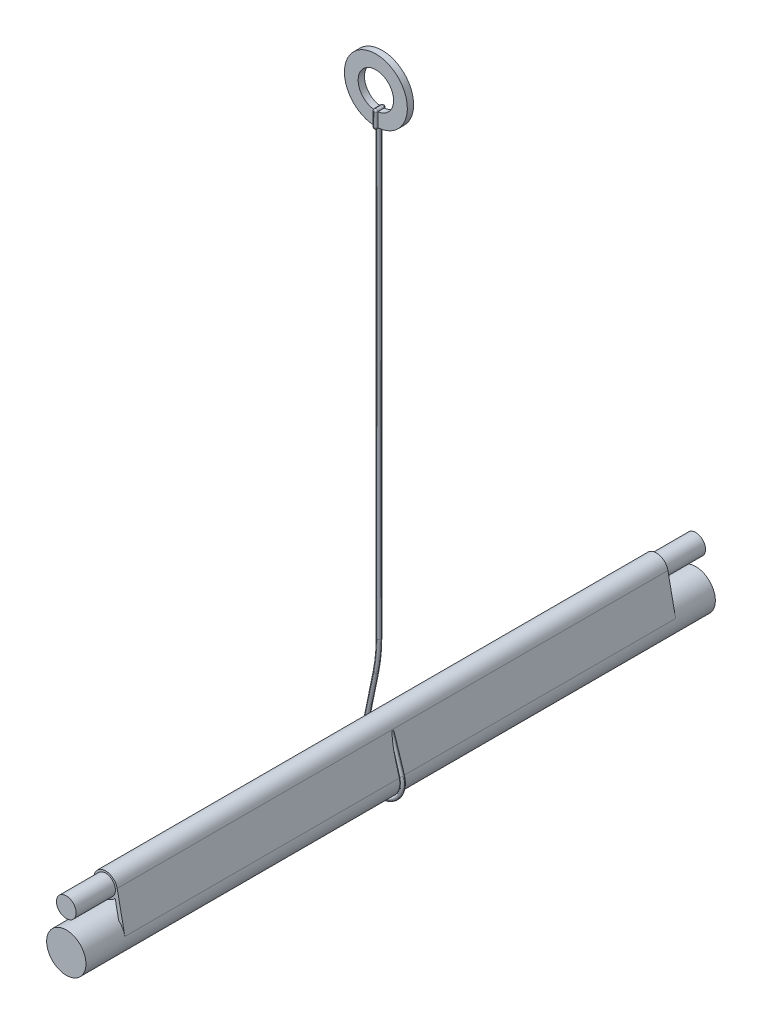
ISO-10303-21;
HEADER;
FILE_DESCRIPTION(('STEP AP214'),'2;1');
FILE_NAME('part.step','',(''),(''),'','','');
FILE_SCHEMA(('AUTOMOTIVE_DESIGN { 1 0 10303 214 1 1 1 1 }'));
ENDSEC;
DATA;
#1=APPLICATION_CONTEXT('core data for automotive mechanical design processes');
#2=APPLICATION_PROTOCOL_DEFINITION('international standard','automotive_design',2000,#1);
#3=PRODUCT_CONTEXT('',#1,'mechanical');
#4=PRODUCT('Part','Part','',(#3));
#5=PRODUCT_RELATED_PRODUCT_CATEGORY('part','',(#4));
#6=PRODUCT_DEFINITION_FORMATION('','',#4);
#7=PRODUCT_DEFINITION_CONTEXT('part definition',#1,'design');
#8=PRODUCT_DEFINITION('design','',#6,#7);
#9=PRODUCT_DEFINITION_SHAPE('','',#8);
#10=(LENGTH_UNIT() NAMED_UNIT(*) SI_UNIT(.MILLI.,.METRE.));
#11=(NAMED_UNIT(*) PLANE_ANGLE_UNIT() SI_UNIT($,.RADIAN.));
#12=(NAMED_UNIT(*) SI_UNIT($,.STERADIAN.) SOLID_ANGLE_UNIT());
#13=UNCERTAINTY_MEASURE_WITH_UNIT(LENGTH_MEASURE(1.E-05),#10,'distance_accuracy_value','');
#14=(GEOMETRIC_REPRESENTATION_CONTEXT(3) GLOBAL_UNCERTAINTY_ASSIGNED_CONTEXT((#13)) GLOBAL_UNIT_ASSIGNED_CONTEXT((#10,
#11,#12)) REPRESENTATION_CONTEXT('',''));
#15=CARTESIAN_POINT('',(0.,0.,0.));
#16=DIRECTION('',(0.,0.,1.));
#17=DIRECTION('',(1.,0.,0.));
#18=AXIS2_PLACEMENT_3D('',#15,#16,#17);
#19=CARTESIAN_POINT('',(2.74073654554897,-1.21998491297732,70.5));
#20=DIRECTION('',(0.994095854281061,-0.108505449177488,0.));
#21=DIRECTION('',(0.108505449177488,0.994095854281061,0.));
#22=AXIS2_PLACEMENT_3D('',#19,#20,#21);
#23=PLANE('',#22);
#24=CARTESIAN_POINT('',(2.88671213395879,0.117401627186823,70.));
#25=DIRECTION('',(0.994095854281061,-0.108505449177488,0.));
#26=DIRECTION('',(-0.108505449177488,-0.994095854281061,0.));
#27=AXIS2_PLACEMENT_3D('',#24,#25,#26);
#28=ELLIPSE('',#27,1.34532956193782,0.5);
#29=CARTESIAN_POINT('',(2.8441169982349,-0.272842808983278,69.5217597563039));
#30=VERTEX_POINT('',#29);
#31=CARTESIAN_POINT('',(2.74073654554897,-1.21998491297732,70.));
#32=VERTEX_POINT('',#31);
#33=EDGE_CURVE('E288',#30,#32,#28,.F.);
#34=ORIENTED_EDGE('',*,*,#33,.T.);
#35=CARTESIAN_POINT('',(2.88671213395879,0.117401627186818,70.));
#36=DIRECTION('',(0.994095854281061,-0.108505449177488,0.));
#37=DIRECTION('',(0.108505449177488,0.994095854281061,0.));
#38=AXIS2_PLACEMENT_3D('',#35,#36,#37);
#39=ELLIPSE('',#38,1.34532956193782,0.5);
#40=CARTESIAN_POINT('',(2.8441169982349,-0.272842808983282,70.4782402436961));
#41=VERTEX_POINT('',#40);
#42=EDGE_CURVE('E290',#32,#41,#39,.F.);
#43=ORIENTED_EDGE('',*,*,#42,.T.);
#44=CARTESIAN_POINT('',(2.8048632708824,-0.632474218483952,70.));
#45=DIRECTION('',(0.994095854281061,-0.108505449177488,0.));
#46=DIRECTION('',(-0.108505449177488,-0.994095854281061,0.));
#47=AXIS2_PLACEMENT_3D('',#44,#45,#46);
#48=ELLIPSE('',#47,1.23979414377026,0.5);
#49=CARTESIAN_POINT('',(2.93938769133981,0.6,70.));
#50=VERTEX_POINT('',#49);
#51=EDGE_CURVE('E285',#41,#50,#48,.F.);
#52=ORIENTED_EDGE('',*,*,#51,.T.);
#53=CARTESIAN_POINT('',(2.8048632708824,-0.632474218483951,70.));
#54=DIRECTION('',(0.994095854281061,-0.108505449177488,0.));
#55=DIRECTION('',(0.108505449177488,0.994095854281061,0.));
#56=AXIS2_PLACEMENT_3D('',#53,#54,#55);
#57=ELLIPSE('',#56,1.23979414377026,0.5);
#58=EDGE_CURVE('E283',#50,#30,#57,.F.);
#59=ORIENTED_EDGE('',*,*,#58,.T.);
#60=EDGE_LOOP('',(#34,#43,#52,#59));
#61=FACE_BOUND('',#60,.T.);
#62=ADVANCED_FACE('F43',(#61),#23,.F.);
#63=CARTESIAN_POINT('',(-0.5,140.,69.2));
#64=DIRECTION('',(0.,0.,-1.));
#65=DIRECTION('',(-1.,0.,0.));
#66=AXIS2_PLACEMENT_3D('',#63,#64,#65);
#67=PLANE('',#66);
#68=DIRECTION('',(0.,1.,0.));
#69=VECTOR('',#68,1.);
#70=CARTESIAN_POINT('',(-1.,140.,69.2));
#71=LINE('',#70,#69);
#72=CARTESIAN_POINT('',(-1.,132.015640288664,69.2));
#73=VERTEX_POINT('',#72);
#74=CARTESIAN_POINT('',(-1.,135.5,69.2));
#75=VERTEX_POINT('',#74);
#76=EDGE_CURVE('E572',#73,#75,#71,.T.);
#77=ORIENTED_EDGE('',*,*,#76,.F.);
#78=CARTESIAN_POINT('',(-0.5,140.,69.2));
#79=DIRECTION('',(0.,0.,-1.));
#80=DIRECTION('',(-1.,0.,0.));
#81=AXIS2_PLACEMENT_3D('',#78,#79,#80);
#82=CIRCLE('',#81,8.00000000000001);
#83=CARTESIAN_POINT('',(0.,132.015640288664,69.2));
#84=VERTEX_POINT('',#83);
#85=EDGE_CURVE('E602',#73,#84,#82,.T.);
#86=ORIENTED_EDGE('',*,*,#85,.T.);
#87=DIRECTION('',(0.,-1.,0.));
#88=VECTOR('',#87,1.);
#89=CARTESIAN_POINT('',(0.,140.,69.2));
#90=LINE('',#89,#88);
#91=CARTESIAN_POINT('',(0.,135.5,69.2));
#92=VERTEX_POINT('',#91);
#93=EDGE_CURVE('E536',#92,#84,#90,.T.);
#94=ORIENTED_EDGE('',*,*,#93,.F.);
#95=CARTESIAN_POINT('',(-0.5,135.5,69.2));
#96=DIRECTION('',(0.,0.,-1.));
#97=DIRECTION('',(-1.,0.,0.));
#98=AXIS2_PLACEMENT_3D('',#95,#96,#97);
#99=CIRCLE('',#98,0.5);
#100=CARTESIAN_POINT('',(-0.000772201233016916,135.527777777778,69.2));
#101=VERTEX_POINT('',#100);
#102=EDGE_CURVE('E578',#92,#101,#99,.F.);
#103=ORIENTED_EDGE('',*,*,#102,.T.);
#104=CARTESIAN_POINT('',(-0.5,140.,69.2));
#105=DIRECTION('',(0.,0.,-1.));
#106=DIRECTION('',(-1.,0.,0.));
#107=AXIS2_PLACEMENT_3D('',#104,#105,#106);
#108=CIRCLE('',#107,4.50000000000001);
#109=CARTESIAN_POINT('',(-0.999227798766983,135.527777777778,69.2));
#110=VERTEX_POINT('',#109);
#111=EDGE_CURVE('E571',#110,#101,#108,.T.);
#112=ORIENTED_EDGE('',*,*,#111,.F.);
#113=CARTESIAN_POINT('',(-0.5,135.5,69.2));
#114=DIRECTION('',(0.,0.,-1.));
#115=DIRECTION('',(-1.,0.,0.));
#116=AXIS2_PLACEMENT_3D('',#113,#114,#115);
#117=CIRCLE('',#116,0.5);
#118=EDGE_CURVE('E543',#110,#75,#117,.F.);
#119=ORIENTED_EDGE('',*,*,#118,.T.);
#120=EDGE_LOOP('',(#77,#86,#94,#103,#112,#119));
#121=FACE_BOUND('',#120,.T.);
#122=ADVANCED_FACE('F450',(#121),#67,.T.);
#123=CARTESIAN_POINT('',(-0.5,140.,70.8));
#124=DIRECTION('',(0.,0.,-1.));
#125=DIRECTION('',(-1.,0.,0.));
#126=AXIS2_PLACEMENT_3D('',#123,#124,#125);
#127=PLANE('',#126);
#128=CARTESIAN_POINT('',(-0.5,140.,70.8));
#129=DIRECTION('',(0.,0.,-1.));
#130=DIRECTION('',(-1.,0.,0.));
#131=AXIS2_PLACEMENT_3D('',#128,#129,#130);
#132=CIRCLE('',#131,8.00000000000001);
#133=CARTESIAN_POINT('',(-0.999999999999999,132.015640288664,70.8));
#134=VERTEX_POINT('',#133);
#135=CARTESIAN_POINT('',(0.,132.015640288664,70.8));
#136=VERTEX_POINT('',#135);
#137=EDGE_CURVE('E600',#134,#136,#132,.T.);
#138=ORIENTED_EDGE('',*,*,#137,.F.);
#139=DIRECTION('',(0.,1.,0.));
#140=VECTOR('',#139,1.);
#141=CARTESIAN_POINT('',(-1.,140.,70.8));
#142=LINE('',#141,#140);
#143=CARTESIAN_POINT('',(-1.,135.5,70.8));
#144=VERTEX_POINT('',#143);
#145=EDGE_CURVE('E595',#134,#144,#142,.T.);
#146=ORIENTED_EDGE('',*,*,#145,.T.);
#147=CARTESIAN_POINT('',(-0.5,135.5,70.8));
#148=DIRECTION('',(0.,0.,-1.));
#149=DIRECTION('',(-1.,0.,0.));
#150=AXIS2_PLACEMENT_3D('',#147,#148,#149);
#151=CIRCLE('',#150,0.5);
#152=CARTESIAN_POINT('',(-0.999227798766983,135.527777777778,70.8));
#153=VERTEX_POINT('',#152);
#154=EDGE_CURVE('E504',#144,#153,#151,.T.);
#155=ORIENTED_EDGE('',*,*,#154,.T.);
#156=CARTESIAN_POINT('',(-0.5,140.,70.8));
#157=DIRECTION('',(0.,0.,-1.));
#158=DIRECTION('',(-1.,0.,0.));
#159=AXIS2_PLACEMENT_3D('',#156,#157,#158);
#160=CIRCLE('',#159,4.50000000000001);
#161=CARTESIAN_POINT('',(-0.000772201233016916,135.527777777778,70.8));
#162=VERTEX_POINT('',#161);
#163=EDGE_CURVE('E563',#153,#162,#160,.T.);
#164=ORIENTED_EDGE('',*,*,#163,.T.);
#165=CARTESIAN_POINT('',(-0.5,135.5,70.8));
#166=DIRECTION('',(0.,0.,-1.));
#167=DIRECTION('',(-1.,0.,0.));
#168=AXIS2_PLACEMENT_3D('',#165,#166,#167);
#169=CIRCLE('',#168,0.5);
#170=CARTESIAN_POINT('',(0.,135.5,70.8));
#171=VERTEX_POINT('',#170);
#172=EDGE_CURVE('E567',#162,#171,#169,.T.);
#173=ORIENTED_EDGE('',*,*,#172,.T.);
#174=DIRECTION('',(0.,-1.,0.));
#175=VECTOR('',#174,1.);
#176=CARTESIAN_POINT('',(0.,140.,70.8));
#177=LINE('',#176,#175);
#178=EDGE_CURVE('E539',#171,#136,#177,.T.);
#179=ORIENTED_EDGE('',*,*,#178,.T.);
#180=EDGE_LOOP('',(#138,#146,#155,#164,#173,#179));
#181=FACE_BOUND('',#180,.T.);
#182=ADVANCED_FACE('F456',(#181),#127,.F.);
#183=CARTESIAN_POINT('',(-0.5,140.,69.2));
#184=DIRECTION('',(0.,0.,1.));
#185=DIRECTION('',(1.,0.,0.));
#186=AXIS2_PLACEMENT_3D('',#183,#184,#185);
#187=CYLINDRICAL_SURFACE('',#186,8.00000000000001);
#188=ORIENTED_EDGE('',*,*,#85,.F.);
#189=DIRECTION('',(0.,0.,1.));
#190=VECTOR('',#189,1.);
#191=CARTESIAN_POINT('',(-1.,132.015640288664,69.2));
#192=LINE('',#191,#190);
#193=EDGE_CURVE('E604',#73,#134,#192,.T.);
#194=ORIENTED_EDGE('',*,*,#193,.T.);
#195=ORIENTED_EDGE('',*,*,#137,.T.);
#196=DIRECTION('',(0.,0.,1.));
#197=VECTOR('',#196,1.);
#198=CARTESIAN_POINT('',(0.,132.015640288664,69.2));
#199=LINE('',#198,#197);
#200=EDGE_CURVE('E609',#136,#84,#199,.F.);
#201=ORIENTED_EDGE('',*,*,#200,.T.);
#202=EDGE_LOOP('',(#188,#194,#195,#201));
#203=FACE_BOUND('',#202,.T.);
#204=ADVANCED_FACE('F627',(#203),#187,.T.);
#205=CARTESIAN_POINT('',(-0.5,140.,69.2));
#206=DIRECTION('',(0.,0.,1.));
#207=DIRECTION('',(1.,0.,0.));
#208=AXIS2_PLACEMENT_3D('',#205,#206,#207);
#209=CYLINDRICAL_SURFACE('',#208,4.50000000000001);
#210=ORIENTED_EDGE('',*,*,#163,.F.);
#211=DIRECTION('',(0.,0.,1.));
#212=VECTOR('',#211,1.);
#213=CARTESIAN_POINT('',(-0.999227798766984,135.527777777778,70.8));
#214=LINE('',#213,#212);
#215=EDGE_CURVE('E581',#153,#110,#214,.F.);
#216=ORIENTED_EDGE('',*,*,#215,.T.);
#217=ORIENTED_EDGE('',*,*,#111,.T.);
#218=DIRECTION('',(0.,0.,1.));
#219=VECTOR('',#218,1.);
#220=CARTESIAN_POINT('',(-0.000772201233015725,135.527777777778,69.2));
#221=LINE('',#220,#219);
#222=EDGE_CURVE('E557',#101,#162,#221,.T.);
#223=ORIENTED_EDGE('',*,*,#222,.T.);
#224=EDGE_LOOP('',(#210,#216,#217,#223));
#225=FACE_BOUND('',#224,.T.);
#226=ADVANCED_FACE('F575',(#225),#209,.F.);
#227=CARTESIAN_POINT('',(-1.,19.0408205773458,70.5));
#228=DIRECTION('',(1.,0.,0.));
#229=DIRECTION('',(0.,1.,0.));
#230=AXIS2_PLACEMENT_3D('',#227,#228,#229);
#231=PLANE('',#230);
#232=DIRECTION('',(0.,-1.,0.));
#233=VECTOR('',#232,1.);
#234=CARTESIAN_POINT('',(-1.,131.5,69.2));
#235=LINE('',#234,#233);
#236=CARTESIAN_POINT('',(-1.,132.,69.2));
#237=VERTEX_POINT('',#236);
#238=EDGE_CURVE('E548',#73,#237,#235,.T.);
#239=ORIENTED_EDGE('',*,*,#238,.T.);
#240=DIRECTION('',(0.,0.,1.));
#241=VECTOR('',#240,1.);
#242=CARTESIAN_POINT('',(-1.,132.,69.5));
#243=LINE('',#242,#241);
#244=CARTESIAN_POINT('',(-1.,132.,70.));
#245=VERTEX_POINT('',#244);
#246=EDGE_CURVE('E198',#237,#245,#243,.T.);
#247=ORIENTED_EDGE('',*,*,#246,.T.);
#248=DIRECTION('',(0.,0.,1.));
#249=VECTOR('',#248,1.);
#250=CARTESIAN_POINT('',(-1.,132.,70.8));
#251=LINE('',#250,#249);
#252=CARTESIAN_POINT('',(-1.,132.,70.8));
#253=VERTEX_POINT('',#252);
#254=EDGE_CURVE('E293',#245,#253,#251,.T.);
#255=ORIENTED_EDGE('',*,*,#254,.T.);
#256=DIRECTION('',(0.,-1.,0.));
#257=VECTOR('',#256,1.);
#258=CARTESIAN_POINT('',(-1.,19.0408205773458,70.8));
#259=LINE('',#258,#257);
#260=EDGE_CURVE('E545',#253,#134,#259,.F.);
#261=ORIENTED_EDGE('',*,*,#260,.T.);
#262=ORIENTED_EDGE('',*,*,#193,.F.);
#263=EDGE_LOOP('',(#239,#247,#255,#261,#262));
#264=FACE_BOUND('',#263,.T.);
#265=ADVANCED_FACE('F856',(#264),#231,.F.);
#266=CARTESIAN_POINT('',(0.,19.0408205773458,70.5));
#267=DIRECTION('',(-1.,0.,0.));
#268=DIRECTION('',(0.,0.,1.));
#269=AXIS2_PLACEMENT_3D('',#266,#267,#268);
#270=PLANE('',#269);
#271=DIRECTION('',(0.,0.,1.));
#272=VECTOR('',#271,1.);
#273=CARTESIAN_POINT('',(0.,132.,70.5));
#274=LINE('',#273,#272);
#275=CARTESIAN_POINT('',(0.,132.,70.8));
#276=VERTEX_POINT('',#275);
#277=CARTESIAN_POINT('',(0.,132.,70.));
#278=VERTEX_POINT('',#277);
#279=EDGE_CURVE('E186',#276,#278,#274,.F.);
#280=ORIENTED_EDGE('',*,*,#279,.T.);
#281=DIRECTION('',(0.,0.,1.));
#282=VECTOR('',#281,1.);
#283=CARTESIAN_POINT('',(0.,132.,69.2));
#284=LINE('',#283,#282);
#285=CARTESIAN_POINT('',(0.,132.,69.2));
#286=VERTEX_POINT('',#285);
#287=EDGE_CURVE('E190',#278,#286,#284,.F.);
#288=ORIENTED_EDGE('',*,*,#287,.T.);
#289=DIRECTION('',(0.,1.,0.));
#290=VECTOR('',#289,1.);
#291=CARTESIAN_POINT('',(0.,135.5,69.2));
#292=LINE('',#291,#290);
#293=EDGE_CURVE('E552',#286,#84,#292,.T.);
#294=ORIENTED_EDGE('',*,*,#293,.T.);
#295=ORIENTED_EDGE('',*,*,#200,.F.);
#296=DIRECTION('',(0.,1.,0.));
#297=VECTOR('',#296,1.);
#298=CARTESIAN_POINT('',(0.,19.0408205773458,70.8));
#299=LINE('',#298,#297);
#300=EDGE_CURVE('E194',#136,#276,#299,.F.);
#301=ORIENTED_EDGE('',*,*,#300,.T.);
#302=EDGE_LOOP('',(#280,#288,#294,#295,#301));
#303=FACE_BOUND('',#302,.T.);
#304=ADVANCED_FACE('F188',(#303),#270,.F.);
#305=CARTESIAN_POINT('',(-0.5,135.5,70.5));
#306=DIRECTION('',(0.,0.,-1.));
#307=DIRECTION('',(-1.,0.,0.));
#308=AXIS2_PLACEMENT_3D('',#305,#306,#307);
#309=CYLINDRICAL_SURFACE('',#308,0.5);
#310=DIRECTION('',(0.,0.,-1.));
#311=VECTOR('',#310,1.);
#312=CARTESIAN_POINT('',(-0.5,136.,70.5));
#313=LINE('',#312,#311);
#314=CARTESIAN_POINT('',(-0.5,136.,69.2));
#315=VERTEX_POINT('',#314);
#316=CARTESIAN_POINT('',(-0.5,136.,70.8));
#317=VERTEX_POINT('',#316);
#318=EDGE_CURVE('E533',#315,#317,#313,.F.);
#319=ORIENTED_EDGE('',*,*,#318,.F.);
#320=CARTESIAN_POINT('',(-0.5,135.5,69.2));
#321=DIRECTION('',(0.,0.,-1.));
#322=DIRECTION('',(-1.,0.,0.));
#323=AXIS2_PLACEMENT_3D('',#320,#321,#322);
#324=CIRCLE('',#323,0.5);
#325=EDGE_CURVE('E286',#315,#110,#324,.F.);
#326=ORIENTED_EDGE('',*,*,#325,.T.);
#327=ORIENTED_EDGE('',*,*,#215,.F.);
#328=CARTESIAN_POINT('',(-0.5,135.5,70.8));
#329=DIRECTION('',(0.,0.,-1.));
#330=DIRECTION('',(-1.,0.,0.));
#331=AXIS2_PLACEMENT_3D('',#328,#329,#330);
#332=CIRCLE('',#331,0.5);
#333=EDGE_CURVE('E501',#153,#317,#332,.T.);
#334=ORIENTED_EDGE('',*,*,#333,.T.);
#335=EDGE_LOOP('',(#319,#326,#327,#334));
#336=FACE_BOUND('',#335,.T.);
#337=ADVANCED_FACE('F466',(#336),#309,.T.);
#338=CARTESIAN_POINT('',(-0.5,135.5,70.5));
#339=DIRECTION('',(0.,0.,-1.));
#340=DIRECTION('',(-1.,0.,0.));
#341=AXIS2_PLACEMENT_3D('',#338,#339,#340);
#342=CYLINDRICAL_SURFACE('',#341,0.5);
#343=ORIENTED_EDGE('',*,*,#222,.F.);
#344=CARTESIAN_POINT('',(-0.5,135.5,69.2));
#345=DIRECTION('',(0.,0.,-1.));
#346=DIRECTION('',(-1.,0.,0.));
#347=AXIS2_PLACEMENT_3D('',#344,#345,#346);
#348=CIRCLE('',#347,0.5);
#349=EDGE_CURVE('E513',#101,#315,#348,.F.);
#350=ORIENTED_EDGE('',*,*,#349,.T.);
#351=ORIENTED_EDGE('',*,*,#318,.T.);
#352=CARTESIAN_POINT('',(-0.5,135.5,70.8));
#353=DIRECTION('',(0.,0.,-1.));
#354=DIRECTION('',(-1.,0.,0.));
#355=AXIS2_PLACEMENT_3D('',#352,#353,#354);
#356=CIRCLE('',#355,0.5);
#357=EDGE_CURVE('E518',#317,#162,#356,.T.);
#358=ORIENTED_EDGE('',*,*,#357,.T.);
#359=EDGE_LOOP('',(#343,#350,#351,#358));
#360=FACE_BOUND('',#359,.T.);
#361=ADVANCED_FACE('F462',(#360),#342,.T.);
#362=CARTESIAN_POINT('',(-0.5,135.5,69.2));
#363=DIRECTION('',(0.,0.,1.));
#364=DIRECTION('',(1.,0.,0.));
#365=AXIS2_PLACEMENT_3D('',#362,#363,#364);
#366=SPHERICAL_SURFACE('',#365,0.5);
#367=ORIENTED_EDGE('',*,*,#349,.F.);
#368=ORIENTED_EDGE('',*,*,#102,.F.);
#369=CARTESIAN_POINT('',(-0.5,135.5,69.2));
#370=DIRECTION('',(0.,-1.,0.));
#371=DIRECTION('',(0.,0.,-1.));
#372=AXIS2_PLACEMENT_3D('',#369,#370,#371);
#373=CIRCLE('',#372,0.5);
#374=CARTESIAN_POINT('',(-0.5,135.5,68.7));
#375=VERTEX_POINT('',#374);
#376=EDGE_CURVE('E277',#375,#92,#373,.T.);
#377=ORIENTED_EDGE('',*,*,#376,.F.);
#378=CARTESIAN_POINT('',(-0.5,135.5,69.2));
#379=DIRECTION('',(-1.,0.,0.));
#380=DIRECTION('',(0.,0.,1.));
#381=AXIS2_PLACEMENT_3D('',#378,#379,#380);
#382=CIRCLE('',#381,0.5);
#383=EDGE_CURVE('E526',#315,#375,#382,.T.);
#384=ORIENTED_EDGE('',*,*,#383,.F.);
#385=EDGE_LOOP('',(#367,#368,#377,#384));
#386=FACE_BOUND('',#385,.T.);
#387=ADVANCED_FACE('F465',(#386),#366,.T.);
#388=CARTESIAN_POINT('',(-0.5,19.0408205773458,69.2));
#389=DIRECTION('',(0.,-1.,0.));
#390=DIRECTION('',(0.,0.,-1.));
#391=AXIS2_PLACEMENT_3D('',#388,#389,#390);
#392=CYLINDRICAL_SURFACE('',#391,0.5);
#393=ORIENTED_EDGE('',*,*,#293,.F.);
#394=CARTESIAN_POINT('',(-0.5,132.,69.2));
#395=DIRECTION('',(0.,-1.,0.));
#396=DIRECTION('',(0.,0.,-1.));
#397=AXIS2_PLACEMENT_3D('',#394,#395,#396);
#398=CIRCLE('',#397,0.5);
#399=CARTESIAN_POINT('',(-0.5,132.,68.7));
#400=VERTEX_POINT('',#399);
#401=EDGE_CURVE('E210',#286,#400,#398,.F.);
#402=ORIENTED_EDGE('',*,*,#401,.T.);
#403=DIRECTION('',(0.,1.,0.));
#404=VECTOR('',#403,1.);
#405=CARTESIAN_POINT('',(-0.5,131.5,68.7));
#406=LINE('',#405,#404);
#407=EDGE_CURVE('E524',#375,#400,#406,.F.);
#408=ORIENTED_EDGE('',*,*,#407,.F.);
#409=ORIENTED_EDGE('',*,*,#376,.T.);
#410=ORIENTED_EDGE('',*,*,#93,.T.);
#411=EDGE_LOOP('',(#393,#402,#408,#409,#410));
#412=FACE_BOUND('',#411,.T.);
#413=ADVANCED_FACE('F479',(#412),#392,.T.);
#414=CARTESIAN_POINT('',(-0.5,135.5,69.2));
#415=DIRECTION('',(0.,0.,1.));
#416=DIRECTION('',(1.,0.,0.));
#417=AXIS2_PLACEMENT_3D('',#414,#415,#416);
#418=SPHERICAL_SURFACE('',#417,0.5);
#419=ORIENTED_EDGE('',*,*,#325,.F.);
#420=ORIENTED_EDGE('',*,*,#383,.T.);
#421=CARTESIAN_POINT('',(-0.5,135.5,69.2));
#422=DIRECTION('',(0.,-1.,0.));
#423=DIRECTION('',(0.,0.,-1.));
#424=AXIS2_PLACEMENT_3D('',#421,#422,#423);
#425=CIRCLE('',#424,0.5);
#426=EDGE_CURVE('E282',#75,#375,#425,.T.);
#427=ORIENTED_EDGE('',*,*,#426,.F.);
#428=ORIENTED_EDGE('',*,*,#118,.F.);
#429=EDGE_LOOP('',(#419,#420,#427,#428));
#430=FACE_BOUND('',#429,.T.);
#431=ADVANCED_FACE('F475',(#430),#418,.T.);
#432=CARTESIAN_POINT('',(-0.500000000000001,19.0408205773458,69.2));
#433=DIRECTION('',(0.,1.,0.));
#434=DIRECTION('',(-1.,0.,0.));
#435=AXIS2_PLACEMENT_3D('',#432,#433,#434);
#436=CYLINDRICAL_SURFACE('',#435,0.5);
#437=ORIENTED_EDGE('',*,*,#407,.T.);
#438=CARTESIAN_POINT('',(-0.5,132.,69.2));
#439=DIRECTION('',(0.,1.,0.));
#440=DIRECTION('',(-1.,0.,0.));
#441=AXIS2_PLACEMENT_3D('',#438,#439,#440);
#442=CIRCLE('',#441,0.5);
#443=EDGE_CURVE('E53',#400,#237,#442,.T.);
#444=ORIENTED_EDGE('',*,*,#443,.T.);
#445=ORIENTED_EDGE('',*,*,#238,.F.);
#446=ORIENTED_EDGE('',*,*,#76,.T.);
#447=ORIENTED_EDGE('',*,*,#426,.T.);
#448=EDGE_LOOP('',(#437,#444,#445,#446,#447));
#449=FACE_BOUND('',#448,.T.);
#450=ADVANCED_FACE('F471',(#449),#436,.T.);
#451=CARTESIAN_POINT('',(-0.5,135.5,70.8));
#452=DIRECTION('',(0.,0.,1.));
#453=DIRECTION('',(1.,0.,0.));
#454=AXIS2_PLACEMENT_3D('',#451,#452,#453);
#455=SPHERICAL_SURFACE('',#454,0.5);
#456=ORIENTED_EDGE('',*,*,#333,.F.);
#457=ORIENTED_EDGE('',*,*,#154,.F.);
#458=CARTESIAN_POINT('',(-0.5,135.5,70.8));
#459=DIRECTION('',(0.,-1.,0.));
#460=DIRECTION('',(0.,0.,-1.));
#461=AXIS2_PLACEMENT_3D('',#458,#459,#460);
#462=CIRCLE('',#461,0.5);
#463=CARTESIAN_POINT('',(-0.5,135.5,71.3));
#464=VERTEX_POINT('',#463);
#465=EDGE_CURVE('E148',#464,#144,#462,.T.);
#466=ORIENTED_EDGE('',*,*,#465,.F.);
#467=CARTESIAN_POINT('',(-0.5,135.5,70.8));
#468=DIRECTION('',(1.,0.,0.));
#469=DIRECTION('',(0.,0.,-1.));
#470=AXIS2_PLACEMENT_3D('',#467,#468,#469);
#471=CIRCLE('',#470,0.5);
#472=EDGE_CURVE('E274',#317,#464,#471,.T.);
#473=ORIENTED_EDGE('',*,*,#472,.F.);
#474=EDGE_LOOP('',(#456,#457,#466,#473));
#475=FACE_BOUND('',#474,.T.);
#476=ADVANCED_FACE('F474',(#475),#455,.T.);
#477=CARTESIAN_POINT('',(-0.5,136.,70.8));
#478=DIRECTION('',(0.,-1.,0.));
#479=DIRECTION('',(1.,0.,0.));
#480=AXIS2_PLACEMENT_3D('',#477,#478,#479);
#481=CYLINDRICAL_SURFACE('',#480,0.5);
#482=ORIENTED_EDGE('',*,*,#260,.F.);
#483=CARTESIAN_POINT('',(-0.5,132.,70.8));
#484=DIRECTION('',(0.,-1.,0.));
#485=DIRECTION('',(1.,0.,0.));
#486=AXIS2_PLACEMENT_3D('',#483,#484,#485);
#487=CIRCLE('',#486,0.5);
#488=CARTESIAN_POINT('',(-0.5,132.,71.3));
#489=VERTEX_POINT('',#488);
#490=EDGE_CURVE('E12',#253,#489,#487,.F.);
#491=ORIENTED_EDGE('',*,*,#490,.T.);
#492=DIRECTION('',(0.,-1.,0.));
#493=VECTOR('',#492,1.);
#494=CARTESIAN_POINT('',(-0.5,136.,71.3));
#495=LINE('',#494,#493);
#496=EDGE_CURVE('E269',#464,#489,#495,.T.);
#497=ORIENTED_EDGE('',*,*,#496,.F.);
#498=ORIENTED_EDGE('',*,*,#465,.T.);
#499=ORIENTED_EDGE('',*,*,#145,.F.);
#500=EDGE_LOOP('',(#482,#491,#497,#498,#499));
#501=FACE_BOUND('',#500,.T.);
#502=ADVANCED_FACE('F492',(#501),#481,.T.);
#503=CARTESIAN_POINT('',(-0.5,135.5,70.8));
#504=DIRECTION('',(0.,0.,1.));
#505=DIRECTION('',(1.,0.,0.));
#506=AXIS2_PLACEMENT_3D('',#503,#504,#505);
#507=SPHERICAL_SURFACE('',#506,0.5);
#508=ORIENTED_EDGE('',*,*,#357,.F.);
#509=ORIENTED_EDGE('',*,*,#472,.T.);
#510=CARTESIAN_POINT('',(-0.5,135.5,70.8));
#511=DIRECTION('',(0.,-1.,0.));
#512=DIRECTION('',(0.,0.,-1.));
#513=AXIS2_PLACEMENT_3D('',#510,#511,#512);
#514=CIRCLE('',#513,0.5);
#515=EDGE_CURVE('E265',#171,#464,#514,.T.);
#516=ORIENTED_EDGE('',*,*,#515,.F.);
#517=ORIENTED_EDGE('',*,*,#172,.F.);
#518=EDGE_LOOP('',(#508,#509,#516,#517));
#519=FACE_BOUND('',#518,.T.);
#520=ADVANCED_FACE('F489',(#519),#507,.T.);
#521=CARTESIAN_POINT('',(-0.5,136.,70.8));
#522=DIRECTION('',(0.,1.,0.));
#523=DIRECTION('',(0.,0.,1.));
#524=AXIS2_PLACEMENT_3D('',#521,#522,#523);
#525=CYLINDRICAL_SURFACE('',#524,0.5);
#526=ORIENTED_EDGE('',*,*,#496,.T.);
#527=CARTESIAN_POINT('',(-0.5,132.,70.8));
#528=DIRECTION('',(0.,1.,0.));
#529=DIRECTION('',(0.,0.,1.));
#530=AXIS2_PLACEMENT_3D('',#527,#528,#529);
#531=CIRCLE('',#530,0.5);
#532=EDGE_CURVE('E298',#489,#276,#531,.T.);
#533=ORIENTED_EDGE('',*,*,#532,.T.);
#534=ORIENTED_EDGE('',*,*,#300,.F.);
#535=ORIENTED_EDGE('',*,*,#178,.F.);
#536=ORIENTED_EDGE('',*,*,#515,.T.);
#537=EDGE_LOOP('',(#526,#533,#534,#535,#536));
#538=FACE_BOUND('',#537,.T.);
#539=ADVANCED_FACE('F448',(#538),#525,.T.);
#540=CARTESIAN_POINT('',(-0.5,132.,69.2));
#541=DIRECTION('',(0.,0.,1.));
#542=DIRECTION('',(1.,0.,0.));
#543=AXIS2_PLACEMENT_3D('',#540,#541,#542);
#544=SPHERICAL_SURFACE('',#543,0.5);
#545=CARTESIAN_POINT('',(-0.5,132.,69.2));
#546=DIRECTION('',(0.,0.,1.));
#547=DIRECTION('',(1.,0.,0.));
#548=AXIS2_PLACEMENT_3D('',#545,#546,#547);
#549=CIRCLE('',#548,0.5);
#550=CARTESIAN_POINT('',(-0.5,131.5,69.2));
#551=VERTEX_POINT('',#550);
#552=EDGE_CURVE('E262',#237,#551,#549,.T.);
#553=ORIENTED_EDGE('',*,*,#552,.F.);
#554=ORIENTED_EDGE('',*,*,#443,.F.);
#555=CARTESIAN_POINT('',(-0.5,132.,69.2));
#556=DIRECTION('',(1.,0.,0.));
#557=DIRECTION('',(0.,0.,-1.));
#558=AXIS2_PLACEMENT_3D('',#555,#556,#557);
#559=CIRCLE('',#558,0.5);
#560=EDGE_CURVE('E47',#551,#400,#559,.T.);
#561=ORIENTED_EDGE('',*,*,#560,.F.);
#562=EDGE_LOOP('',(#553,#554,#561));
#563=FACE_BOUND('',#562,.T.);
#564=ADVANCED_FACE('F45',(#563),#544,.T.);
#565=CARTESIAN_POINT('',(-0.5,132.,69.2));
#566=DIRECTION('',(0.,0.,1.));
#567=DIRECTION('',(1.,0.,0.));
#568=AXIS2_PLACEMENT_3D('',#565,#566,#567);
#569=SPHERICAL_SURFACE('',#568,0.5);
#570=ORIENTED_EDGE('',*,*,#560,.T.);
#571=ORIENTED_EDGE('',*,*,#401,.F.);
#572=CARTESIAN_POINT('',(-0.5,132.,69.2));
#573=DIRECTION('',(0.,0.,1.));
#574=DIRECTION('',(1.,0.,0.));
#575=AXIS2_PLACEMENT_3D('',#572,#573,#574);
#576=CIRCLE('',#575,0.5);
#577=EDGE_CURVE('E209',#551,#286,#576,.T.);
#578=ORIENTED_EDGE('',*,*,#577,.F.);
#579=EDGE_LOOP('',(#570,#571,#578));
#580=FACE_BOUND('',#579,.T.);
#581=ADVANCED_FACE('F443',(#580),#569,.T.);
#582=CARTESIAN_POINT('',(-0.5,132.,70.5));
#583=DIRECTION('',(0.,0.,-1.));
#584=DIRECTION('',(-1.,0.,0.));
#585=AXIS2_PLACEMENT_3D('',#582,#583,#584);
#586=CYLINDRICAL_SURFACE('',#585,0.5);
#587=ORIENTED_EDGE('',*,*,#246,.F.);
#588=ORIENTED_EDGE('',*,*,#552,.T.);
#589=DIRECTION('',(0.,0.,1.));
#590=VECTOR('',#589,1.);
#591=CARTESIAN_POINT('',(-0.5,131.5,69.2));
#592=LINE('',#591,#590);
#593=CARTESIAN_POINT('',(-0.5,131.5,69.5));
#594=VERTEX_POINT('',#593);
#595=EDGE_CURVE('E259',#594,#551,#592,.F.);
#596=ORIENTED_EDGE('',*,*,#595,.F.);
#597=CARTESIAN_POINT('',(-0.5,132.,70.));
#598=DIRECTION('',(0.,0.707106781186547,-0.707106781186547));
#599=DIRECTION('',(0.,-0.707106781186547,-0.707106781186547));
#600=AXIS2_PLACEMENT_3D('',#597,#598,#599);
#601=ELLIPSE('',#600,0.707106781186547,0.5);
#602=EDGE_CURVE('E256',#245,#594,#601,.F.);
#603=ORIENTED_EDGE('',*,*,#602,.F.);
#604=EDGE_LOOP('',(#587,#588,#596,#603));
#605=FACE_BOUND('',#604,.T.);
#606=ADVANCED_FACE('F440',(#605),#586,.T.);
#607=CARTESIAN_POINT('',(-0.5,132.,70.8));
#608=DIRECTION('',(0.,0.,1.));
#609=DIRECTION('',(1.,0.,0.));
#610=AXIS2_PLACEMENT_3D('',#607,#608,#609);
#611=SPHERICAL_SURFACE('',#610,0.5);
#612=CARTESIAN_POINT('',(-0.5,132.,70.8));
#613=DIRECTION('',(1.,0.,0.));
#614=DIRECTION('',(0.,0.,-1.));
#615=AXIS2_PLACEMENT_3D('',#612,#613,#614);
#616=CIRCLE('',#615,0.5);
#617=CARTESIAN_POINT('',(-0.5,131.5,70.8));
#618=VERTEX_POINT('',#617);
#619=EDGE_CURVE('E132',#489,#618,#616,.T.);
#620=ORIENTED_EDGE('',*,*,#619,.F.);
#621=ORIENTED_EDGE('',*,*,#490,.F.);
#622=CARTESIAN_POINT('',(-0.5,132.,70.8));
#623=DIRECTION('',(0.,0.,-1.));
#624=DIRECTION('',(-1.,0.,0.));
#625=AXIS2_PLACEMENT_3D('',#622,#623,#624);
#626=CIRCLE('',#625,0.5);
#627=EDGE_CURVE('E253',#618,#253,#626,.T.);
#628=ORIENTED_EDGE('',*,*,#627,.F.);
#629=EDGE_LOOP('',(#620,#621,#628));
#630=FACE_BOUND('',#629,.T.);
#631=ADVANCED_FACE('F437',(#630),#611,.T.);
#632=CARTESIAN_POINT('',(-0.5,132.,70.8));
#633=DIRECTION('',(0.,0.,1.));
#634=DIRECTION('',(1.,0.,0.));
#635=AXIS2_PLACEMENT_3D('',#632,#633,#634);
#636=SPHERICAL_SURFACE('',#635,0.5);
#637=ORIENTED_EDGE('',*,*,#532,.F.);
#638=ORIENTED_EDGE('',*,*,#619,.T.);
#639=CARTESIAN_POINT('',(-0.5,132.,70.8));
#640=DIRECTION('',(0.,0.,-1.));
#641=DIRECTION('',(-1.,0.,0.));
#642=AXIS2_PLACEMENT_3D('',#639,#640,#641);
#643=CIRCLE('',#642,0.5);
#644=EDGE_CURVE('E219',#276,#618,#643,.T.);
#645=ORIENTED_EDGE('',*,*,#644,.F.);
#646=EDGE_LOOP('',(#637,#638,#645));
#647=FACE_BOUND('',#646,.T.);
#648=ADVANCED_FACE('F434',(#647),#636,.T.);
#649=CARTESIAN_POINT('',(-0.5,132.,68.7));
#650=DIRECTION('',(0.,0.,-1.));
#651=DIRECTION('',(-1.,0.,0.));
#652=AXIS2_PLACEMENT_3D('',#649,#650,#651);
#653=CYLINDRICAL_SURFACE('',#652,0.5);
#654=ORIENTED_EDGE('',*,*,#577,.T.);
#655=ORIENTED_EDGE('',*,*,#287,.F.);
#656=CARTESIAN_POINT('',(-0.5,132.,70.));
#657=DIRECTION('',(0.,0.707106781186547,-0.707106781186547));
#658=DIRECTION('',(0.,-0.707106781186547,-0.707106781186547));
#659=AXIS2_PLACEMENT_3D('',#656,#657,#658);
#660=ELLIPSE('',#659,0.707106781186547,0.5);
#661=EDGE_CURVE('E206',#594,#278,#660,.F.);
#662=ORIENTED_EDGE('',*,*,#661,.F.);
#663=ORIENTED_EDGE('',*,*,#595,.T.);
#664=EDGE_LOOP('',(#654,#655,#662,#663));
#665=FACE_BOUND('',#664,.T.);
#666=ADVANCED_FACE('F204',(#665),#653,.T.);
#667=CARTESIAN_POINT('',(-0.500000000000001,19.0408205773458,70.));
#668=DIRECTION('',(0.,-1.,0.));
#669=DIRECTION('',(1.,0.,0.));
#670=AXIS2_PLACEMENT_3D('',#667,#668,#669);
#671=CYLINDRICAL_SURFACE('',#670,0.5);
#672=DIRECTION('',(0.,-1.,0.));
#673=VECTOR('',#672,1.);
#674=CARTESIAN_POINT('',(-1.,19.0408205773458,70.));
#675=LINE('',#674,#673);
#676=CARTESIAN_POINT('',(-1.,19.0408205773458,70.));
#677=VERTEX_POINT('',#676);
#678=EDGE_CURVE('E244',#245,#677,#675,.T.);
#679=ORIENTED_EDGE('',*,*,#678,.F.);
#680=ORIENTED_EDGE('',*,*,#602,.T.);
#681=DIRECTION('',(0.,-1.,0.));
#682=VECTOR('',#681,1.);
#683=CARTESIAN_POINT('',(-0.500000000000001,-10.,69.5));
#684=LINE('',#683,#682);
#685=CARTESIAN_POINT('',(-0.499999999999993,19.0408205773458,69.5));
#686=VERTEX_POINT('',#685);
#687=EDGE_CURVE('E218',#686,#594,#684,.F.);
#688=ORIENTED_EDGE('',*,*,#687,.F.);
#689=CARTESIAN_POINT('',(-0.500000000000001,19.0408205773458,70.));
#690=DIRECTION('',(0.,-1.,0.));
#691=DIRECTION('',(0.,0.,-1.));
#692=AXIS2_PLACEMENT_3D('',#689,#690,#691);
#693=CIRCLE('',#692,0.5);
#694=EDGE_CURVE('E247',#677,#686,#693,.T.);
#695=ORIENTED_EDGE('',*,*,#694,.F.);
#696=EDGE_LOOP('',(#679,#680,#688,#695));
#697=FACE_BOUND('',#696,.T.);
#698=ADVANCED_FACE('F427',(#697),#671,.T.);
#699=CARTESIAN_POINT('',(-0.5,132.,70.5));
#700=DIRECTION('',(0.,0.,-1.));
#701=DIRECTION('',(-1.,0.,0.));
#702=AXIS2_PLACEMENT_3D('',#699,#700,#701);
#703=CYLINDRICAL_SURFACE('',#702,0.5);
#704=DIRECTION('',(0.,0.,1.));
#705=VECTOR('',#704,1.);
#706=CARTESIAN_POINT('',(-0.5,131.5,70.5));
#707=LINE('',#706,#705);
#708=CARTESIAN_POINT('',(-0.5,131.5,70.5));
#709=VERTEX_POINT('',#708);
#710=EDGE_CURVE('E225',#618,#709,#707,.F.);
#711=ORIENTED_EDGE('',*,*,#710,.F.);
#712=ORIENTED_EDGE('',*,*,#627,.T.);
#713=ORIENTED_EDGE('',*,*,#254,.F.);
#714=CARTESIAN_POINT('',(-0.5,132.,70.));
#715=DIRECTION('',(0.,-0.707106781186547,-0.707106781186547));
#716=DIRECTION('',(0.,0.707106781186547,-0.707106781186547));
#717=AXIS2_PLACEMENT_3D('',#714,#715,#716);
#718=ELLIPSE('',#717,0.707106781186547,0.5);
#719=EDGE_CURVE('E242',#709,#245,#718,.T.);
#720=ORIENTED_EDGE('',*,*,#719,.F.);
#721=EDGE_LOOP('',(#711,#712,#713,#720));
#722=FACE_BOUND('',#721,.T.);
#723=ADVANCED_FACE('F424',(#722),#703,.T.);
#724=CARTESIAN_POINT('',(-0.5,132.,68.7));
#725=DIRECTION('',(0.,0.,-1.));
#726=DIRECTION('',(-1.,0.,0.));
#727=AXIS2_PLACEMENT_3D('',#724,#725,#726);
#728=CYLINDRICAL_SURFACE('',#727,0.5);
#729=ORIENTED_EDGE('',*,*,#644,.T.);
#730=ORIENTED_EDGE('',*,*,#710,.T.);
#731=CARTESIAN_POINT('',(-0.5,132.,70.));
#732=DIRECTION('',(0.,-0.707106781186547,-0.707106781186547));
#733=DIRECTION('',(0.,0.707106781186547,-0.707106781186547));
#734=AXIS2_PLACEMENT_3D('',#731,#732,#733);
#735=ELLIPSE('',#734,0.707106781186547,0.5);
#736=EDGE_CURVE('E222',#278,#709,#735,.T.);
#737=ORIENTED_EDGE('',*,*,#736,.F.);
#738=ORIENTED_EDGE('',*,*,#279,.F.);
#739=EDGE_LOOP('',(#729,#730,#737,#738));
#740=FACE_BOUND('',#739,.T.);
#741=ADVANCED_FACE('F223',(#740),#728,.T.);
#742=CARTESIAN_POINT('',(-0.5,19.0408205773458,70.));
#743=DIRECTION('',(0.,1.,0.));
#744=DIRECTION('',(0.,0.,1.));
#745=AXIS2_PLACEMENT_3D('',#742,#743,#744);
#746=CYLINDRICAL_SURFACE('',#745,0.5);
#747=ORIENTED_EDGE('',*,*,#687,.T.);
#748=ORIENTED_EDGE('',*,*,#661,.T.);
#749=DIRECTION('',(0.,1.,0.));
#750=VECTOR('',#749,1.);
#751=CARTESIAN_POINT('',(0.,19.0408205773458,70.));
#752=LINE('',#751,#750);
#753=CARTESIAN_POINT('',(0.,19.0408205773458,70.));
#754=VERTEX_POINT('',#753);
#755=EDGE_CURVE('E216',#754,#278,#752,.T.);
#756=ORIENTED_EDGE('',*,*,#755,.F.);
#757=CARTESIAN_POINT('',(-0.5,19.0408205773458,70.));
#758=DIRECTION('',(0.,-1.,0.));
#759=DIRECTION('',(0.,0.,-1.));
#760=AXIS2_PLACEMENT_3D('',#757,#758,#759);
#761=CIRCLE('',#760,0.5);
#762=EDGE_CURVE('E235',#686,#754,#761,.T.);
#763=ORIENTED_EDGE('',*,*,#762,.F.);
#764=EDGE_LOOP('',(#747,#748,#756,#763));
#765=FACE_BOUND('',#764,.T.);
#766=ADVANCED_FACE('F213',(#765),#746,.T.);
#767=CARTESIAN_POINT('',(-40.,19.0408205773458,70.));
#768=DIRECTION('',(0.,0.,1.));
#769=DIRECTION('',(1.,0.,0.));
#770=AXIS2_PLACEMENT_3D('',#767,#768,#769);
#771=TOROIDAL_SURFACE('',#770,39.5,0.5);
#772=CARTESIAN_POINT('',(-40.,19.0408205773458,70.));
#773=DIRECTION('',(0.,0.,1.));
#774=DIRECTION('',(1.,0.,0.));
#775=AXIS2_PLACEMENT_3D('',#772,#773,#774);
#776=CIRCLE('',#775,39.);
#777=CARTESIAN_POINT('',(-1.78796001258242,11.2408205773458,70.));
#778=VERTEX_POINT('',#777);
#779=EDGE_CURVE('E639',#677,#778,#776,.F.);
#780=ORIENTED_EDGE('',*,*,#779,.F.);
#781=ORIENTED_EDGE('',*,*,#694,.T.);
#782=CARTESIAN_POINT('',(-40.,19.0408205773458,69.5));
#783=DIRECTION('',(0.,0.,1.));
#784=DIRECTION('',(1.,0.,0.));
#785=AXIS2_PLACEMENT_3D('',#782,#783,#784);
#786=CIRCLE('',#785,39.5);
#787=CARTESIAN_POINT('',(-1.29806206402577,11.1408205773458,69.5));
#788=VERTEX_POINT('',#787);
#789=EDGE_CURVE('E237',#788,#686,#786,.T.);
#790=ORIENTED_EDGE('',*,*,#789,.F.);
#791=CARTESIAN_POINT('',(-1.29806206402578,11.1408205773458,70.));
#792=DIRECTION('',(-0.199999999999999,-0.979795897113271,0.));
#793=DIRECTION('',(0.979795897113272,-0.199999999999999,0.));
#794=AXIS2_PLACEMENT_3D('',#791,#792,#793);
#795=CIRCLE('',#794,0.5);
#796=EDGE_CURVE('E654',#778,#788,#795,.T.);
#797=ORIENTED_EDGE('',*,*,#796,.F.);
#798=EDGE_LOOP('',(#780,#781,#790,#797));
#799=FACE_BOUND('',#798,.T.);
#800=ADVANCED_FACE('F415',(#799),#771,.T.);
#801=CARTESIAN_POINT('',(-0.500000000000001,-10.,70.));
#802=DIRECTION('',(0.,1.,0.));
#803=DIRECTION('',(-1.,0.,0.));
#804=AXIS2_PLACEMENT_3D('',#801,#802,#803);
#805=CYLINDRICAL_SURFACE('',#804,0.5);
#806=DIRECTION('',(0.,-1.,0.));
#807=VECTOR('',#806,1.);
#808=CARTESIAN_POINT('',(-0.500000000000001,19.0408205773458,70.5));
#809=LINE('',#808,#807);
#810=CARTESIAN_POINT('',(-0.499999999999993,19.0408205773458,70.5));
#811=VERTEX_POINT('',#810);
#812=EDGE_CURVE('E228',#709,#811,#809,.T.);
#813=ORIENTED_EDGE('',*,*,#812,.F.);
#814=ORIENTED_EDGE('',*,*,#719,.T.);
#815=ORIENTED_EDGE('',*,*,#678,.T.);
#816=CARTESIAN_POINT('',(-0.500000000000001,19.0408205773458,70.));
#817=DIRECTION('',(0.,-1.,0.));
#818=DIRECTION('',(0.,0.,-1.));
#819=AXIS2_PLACEMENT_3D('',#816,#817,#818);
#820=CIRCLE('',#819,0.5);
#821=EDGE_CURVE('E635',#811,#677,#820,.T.);
#822=ORIENTED_EDGE('',*,*,#821,.F.);
#823=EDGE_LOOP('',(#813,#814,#815,#822));
#824=FACE_BOUND('',#823,.T.);
#825=ADVANCED_FACE('F412',(#824),#805,.T.);
#826=CARTESIAN_POINT('',(-0.5,-10.,70.));
#827=DIRECTION('',(0.,-1.,0.));
#828=DIRECTION('',(0.,0.,-1.));
#829=AXIS2_PLACEMENT_3D('',#826,#827,#828);
#830=CYLINDRICAL_SURFACE('',#829,0.5);
#831=ORIENTED_EDGE('',*,*,#736,.T.);
#832=ORIENTED_EDGE('',*,*,#812,.T.);
#833=CARTESIAN_POINT('',(-0.5,19.0408205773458,70.));
#834=DIRECTION('',(0.,-1.,0.));
#835=DIRECTION('',(0.,0.,-1.));
#836=AXIS2_PLACEMENT_3D('',#833,#834,#835);
#837=CIRCLE('',#836,0.5);
#838=EDGE_CURVE('E233',#754,#811,#837,.T.);
#839=ORIENTED_EDGE('',*,*,#838,.F.);
#840=ORIENTED_EDGE('',*,*,#755,.T.);
#841=EDGE_LOOP('',(#831,#832,#839,#840));
#842=FACE_BOUND('',#841,.T.);
#843=ADVANCED_FACE('F231',(#842),#830,.T.);
#844=CARTESIAN_POINT('',(-40.,19.0408205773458,70.));
#845=DIRECTION('',(0.,0.,1.));
#846=DIRECTION('',(1.,0.,0.));
#847=AXIS2_PLACEMENT_3D('',#844,#845,#846);
#848=TOROIDAL_SURFACE('',#847,39.5,0.5);
#849=ORIENTED_EDGE('',*,*,#789,.T.);
#850=ORIENTED_EDGE('',*,*,#762,.T.);
#851=CARTESIAN_POINT('',(-40.,19.0408205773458,70.));
#852=DIRECTION('',(0.,0.,1.));
#853=DIRECTION('',(1.,0.,0.));
#854=AXIS2_PLACEMENT_3D('',#851,#852,#853);
#855=CIRCLE('',#854,40.);
#856=CARTESIAN_POINT('',(-0.808164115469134,11.0408205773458,70.));
#857=VERTEX_POINT('',#856);
#858=EDGE_CURVE('E648',#857,#754,#855,.T.);
#859=ORIENTED_EDGE('',*,*,#858,.F.);
#860=CARTESIAN_POINT('',(-1.29806206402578,11.1408205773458,70.));
#861=DIRECTION('',(-0.199999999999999,-0.979795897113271,0.));
#862=DIRECTION('',(0.979795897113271,-0.199999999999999,0.));
#863=AXIS2_PLACEMENT_3D('',#860,#861,#862);
#864=CIRCLE('',#863,0.5);
#865=EDGE_CURVE('E650',#788,#857,#864,.T.);
#866=ORIENTED_EDGE('',*,*,#865,.F.);
#867=EDGE_LOOP('',(#849,#850,#859,#866));
#868=FACE_BOUND('',#867,.T.);
#869=ADVANCED_FACE('F405',(#868),#848,.T.);
#870=CARTESIAN_POINT('',(-1.29806206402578,11.1408205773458,70.));
#871=DIRECTION('',(-0.2,-0.979795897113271,0.));
#872=DIRECTION('',(0.979795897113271,-0.2,0.));
#873=AXIS2_PLACEMENT_3D('',#870,#871,#872);
#874=CYLINDRICAL_SURFACE('',#873,0.5);
#875=DIRECTION('',(-0.2,-0.979795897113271,0.));
#876=VECTOR('',#875,1.);
#877=CARTESIAN_POINT('',(-1.78796001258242,11.2408205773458,70.));
#878=LINE('',#877,#876);
#879=CARTESIAN_POINT('',(-5.87877538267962,-8.8,70.));
#880=VERTEX_POINT('',#879);
#881=EDGE_CURVE('E663',#778,#880,#878,.T.);
#882=ORIENTED_EDGE('',*,*,#881,.F.);
#883=ORIENTED_EDGE('',*,*,#796,.T.);
#884=DIRECTION('',(-0.2,-0.979795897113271,0.));
#885=VECTOR('',#884,1.);
#886=CARTESIAN_POINT('',(-5.38887743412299,-8.9,69.5));
#887=LINE('',#886,#885);
#888=CARTESIAN_POINT('',(-5.38887743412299,-8.9,69.5));
#889=VERTEX_POINT('',#888);
#890=EDGE_CURVE('E380',#889,#788,#887,.F.);
#891=ORIENTED_EDGE('',*,*,#890,.F.);
#892=CARTESIAN_POINT('',(-5.38887743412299,-8.9,70.));
#893=DIRECTION('',(-0.199999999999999,-0.979795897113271,0.));
#894=DIRECTION('',(0.979795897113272,-0.199999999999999,0.));
#895=AXIS2_PLACEMENT_3D('',#892,#893,#894);
#896=CIRCLE('',#895,0.5);
#897=EDGE_CURVE('E381',#880,#889,#896,.T.);
#898=ORIENTED_EDGE('',*,*,#897,.F.);
#899=EDGE_LOOP('',(#882,#883,#891,#898));
#900=FACE_BOUND('',#899,.T.);
#901=ADVANCED_FACE('F401',(#900),#874,.T.);
#902=CARTESIAN_POINT('',(-40.,19.0408205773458,70.));
#903=DIRECTION('',(0.,0.,1.));
#904=DIRECTION('',(1.,0.,0.));
#905=AXIS2_PLACEMENT_3D('',#902,#903,#904);
#906=TOROIDAL_SURFACE('',#905,39.5,0.5);
#907=CARTESIAN_POINT('',(-40.,19.0408205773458,70.5));
#908=DIRECTION('',(0.,0.,1.));
#909=DIRECTION('',(1.,0.,0.));
#910=AXIS2_PLACEMENT_3D('',#907,#908,#909);
#911=CIRCLE('',#910,39.5);
#912=CARTESIAN_POINT('',(-1.29806206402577,11.1408205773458,70.5));
#913=VERTEX_POINT('',#912);
#914=EDGE_CURVE('E640',#811,#913,#911,.F.);
#915=ORIENTED_EDGE('',*,*,#914,.F.);
#916=ORIENTED_EDGE('',*,*,#821,.T.);
#917=ORIENTED_EDGE('',*,*,#779,.T.);
#918=CARTESIAN_POINT('',(-1.29806206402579,11.1408205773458,70.));
#919=DIRECTION('',(-0.199999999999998,-0.979795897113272,0.));
#920=DIRECTION('',(0.979795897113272,-0.199999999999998,0.));
#921=AXIS2_PLACEMENT_3D('',#918,#919,#920);
#922=CIRCLE('',#921,0.5);
#923=EDGE_CURVE('E644',#913,#778,#922,.T.);
#924=ORIENTED_EDGE('',*,*,#923,.F.);
#925=EDGE_LOOP('',(#915,#916,#917,#924));
#926=FACE_BOUND('',#925,.T.);
#927=ADVANCED_FACE('F397',(#926),#906,.T.);
#928=CARTESIAN_POINT('',(-40.,19.0408205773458,70.));
#929=DIRECTION('',(0.,0.,1.));
#930=DIRECTION('',(1.,0.,0.));
#931=AXIS2_PLACEMENT_3D('',#928,#929,#930);
#932=TOROIDAL_SURFACE('',#931,39.5,0.5);
#933=ORIENTED_EDGE('',*,*,#838,.T.);
#934=ORIENTED_EDGE('',*,*,#914,.T.);
#935=CARTESIAN_POINT('',(-1.29806206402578,11.1408205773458,70.));
#936=DIRECTION('',(-0.199999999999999,-0.979795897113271,0.));
#937=DIRECTION('',(0.979795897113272,-0.199999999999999,0.));
#938=AXIS2_PLACEMENT_3D('',#935,#936,#937);
#939=CIRCLE('',#938,0.5);
#940=EDGE_CURVE('E670',#857,#913,#939,.T.);
#941=ORIENTED_EDGE('',*,*,#940,.F.);
#942=ORIENTED_EDGE('',*,*,#858,.T.);
#943=EDGE_LOOP('',(#933,#934,#941,#942));
#944=FACE_BOUND('',#943,.T.);
#945=ADVANCED_FACE('F389',(#944),#932,.T.);
#946=CARTESIAN_POINT('',(5.26219908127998,-8.40013142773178,70.));
#947=DIRECTION('',(-0.301621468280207,0.953427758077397,0.));
#948=DIRECTION('',(-0.953427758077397,-0.301621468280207,0.));
#949=AXIS2_PLACEMENT_3D('',#946,#947,#948);
#950=CYLINDRICAL_SURFACE('',#949,0.5);
#951=CARTESIAN_POINT('',(5.73891296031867,-8.24932069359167,70.));
#952=CARTESIAN_POINT('',(5.73893576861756,-8.24931359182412,69.9718723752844));
#953=CARTESIAN_POINT('',(5.73664768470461,-8.25002450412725,69.9437518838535));
#954=CARTESIAN_POINT('',(5.7276176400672,-8.25283007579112,69.8883253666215));
#955=CARTESIAN_POINT('',(5.72087878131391,-8.25492377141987,69.8610187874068));
#956=CARTESIAN_POINT('',(5.70311033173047,-8.26044410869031,69.8079660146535));
#957=CARTESIAN_POINT('',(5.69207864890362,-8.26387140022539,69.782220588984));
#958=CARTESIAN_POINT('',(5.66604870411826,-8.2719580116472,69.7330413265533));
#959=CARTESIAN_POINT('',(5.65105155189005,-8.27661698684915,69.7096068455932));
#960=CARTESIAN_POINT('',(5.6175148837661,-8.28703492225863,69.6657091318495));
#961=CARTESIAN_POINT('',(5.59897576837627,-8.29279375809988,69.6452455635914));
#962=CARTESIAN_POINT('',(5.55886973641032,-8.30525128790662,69.6078572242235));
#963=CARTESIAN_POINT('',(5.53730125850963,-8.31195046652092,69.5909342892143));
#964=CARTESIAN_POINT('',(5.49174402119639,-8.32609969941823,69.5611126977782));
#965=CARTESIAN_POINT('',(5.46775384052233,-8.33355019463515,69.5482164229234));
#966=CARTESIAN_POINT('',(5.41808232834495,-8.34897536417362,69.5268452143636));
#967=CARTESIAN_POINT('',(5.39240389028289,-8.35694914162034,69.5183629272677));
#968=CARTESIAN_POINT('',(5.34526399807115,-8.37158618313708,69.507255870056));
#969=CARTESIAN_POINT('',(5.32397771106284,-8.3781952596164,69.5038024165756));
#970=CARTESIAN_POINT('',(5.28888158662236,-8.38909145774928,69.5006201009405));
#971=CARTESIAN_POINT('',(5.27514211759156,-8.39335695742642,69.4999974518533));
#972=CARTESIAN_POINT('',(5.26140506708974,-8.39762154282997,69.5));
#973=B_SPLINE_CURVE_WITH_KNOTS('',3,(#951,#952,#953,#954,#955,#956,#957,#958,#959,#960,#961,
#962,#963,#964,#965,#966,#967,#968,#969,#970,#971,#972),.UNSPECIFIED.,.F.,.F.,(4,2,2,2,2,2,2,2,
2,2,4),(0.,0.0842707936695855,0.168482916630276,0.2527361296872,0.336965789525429,
0.421185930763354,0.505449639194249,0.589763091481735,0.673935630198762,0.741393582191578,
0.784539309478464),.UNSPECIFIED.);
#974=CARTESIAN_POINT('',(5.26182919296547,-8.39748987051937,69.500000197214));
#975=VERTEX_POINT('',#974);
#976=CARTESIAN_POINT('',(5.73891296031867,-8.24932069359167,70.));
#977=VERTEX_POINT('',#976);
#978=EDGE_CURVE('E373',#975,#977,#973,.F.);
#979=ORIENTED_EDGE('',*,*,#978,.F.);
#980=CARTESIAN_POINT('',(5.26921075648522,-8.42229538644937,70.));
#981=DIRECTION('',(-0.958462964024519,-0.285217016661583,0.));
#982=DIRECTION('',(0.285217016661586,-0.958462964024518,0.));
#983=AXIS2_PLACEMENT_3D('',#980,#981,#982);
#984=ELLIPSE('',#983,29.1389118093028,0.5);
#985=EDGE_CURVE('E345',#30,#975,#984,.T.);
#986=ORIENTED_EDGE('',*,*,#985,.F.);
#987=ORIENTED_EDGE('',*,*,#58,.F.);
#988=DIRECTION('',(-0.301621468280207,0.953427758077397,0.));
#989=VECTOR('',#988,1.);
#990=CARTESIAN_POINT('',(5.73891296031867,-8.24932069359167,70.));
#991=LINE('',#990,#989);
#992=EDGE_CURVE('E340',#977,#50,#991,.T.);
#993=ORIENTED_EDGE('',*,*,#992,.F.);
#994=EDGE_LOOP('',(#979,#986,#987,#993));
#995=FACE_BOUND('',#994,.T.);
#996=ADVANCED_FACE('F384',(#995),#950,.T.);
#997=CARTESIAN_POINT('',(-1.29806206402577,11.1408205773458,70.));
#998=DIRECTION('',(0.2,0.979795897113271,0.));
#999=DIRECTION('',(-0.979795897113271,0.2,0.));
#1000=AXIS2_PLACEMENT_3D('',#997,#998,#999);
#1001=CYLINDRICAL_SURFACE('',#1000,0.5);
#1002=ORIENTED_EDGE('',*,*,#890,.T.);
#1003=ORIENTED_EDGE('',*,*,#865,.T.);
#1004=DIRECTION('',(0.2,0.979795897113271,0.));
#1005=VECTOR('',#1004,1.);
#1006=CARTESIAN_POINT('',(-0.808164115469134,11.0408205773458,70.));
#1007=LINE('',#1006,#1005);
#1008=CARTESIAN_POINT('',(-4.89897948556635,-9.,70.));
#1009=VERTEX_POINT('',#1008);
#1010=EDGE_CURVE('E674',#1009,#857,#1007,.T.);
#1011=ORIENTED_EDGE('',*,*,#1010,.F.);
#1012=CARTESIAN_POINT('',(-5.38887743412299,-8.9,70.));
#1013=DIRECTION('',(-0.199999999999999,-0.979795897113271,0.));
#1014=DIRECTION('',(0.979795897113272,-0.199999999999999,0.));
#1015=AXIS2_PLACEMENT_3D('',#1012,#1013,#1014);
#1016=CIRCLE('',#1015,0.5);
#1017=EDGE_CURVE('E677',#889,#1009,#1016,.T.);
#1018=ORIENTED_EDGE('',*,*,#1017,.F.);
#1019=EDGE_LOOP('',(#1002,#1003,#1011,#1018));
#1020=FACE_BOUND('',#1019,.T.);
#1021=ADVANCED_FACE('F367',(#1020),#1001,.T.);
#1022=CARTESIAN_POINT('',(0.,-10.,70.));
#1023=DIRECTION('',(0.,0.,1.));
#1024=DIRECTION('',(1.,0.,0.));
#1025=AXIS2_PLACEMENT_3D('',#1022,#1023,#1024);
#1026=TOROIDAL_SURFACE('',#1025,5.5,0.5);
#1027=CARTESIAN_POINT('',(0.,-10.,70.));
#1028=DIRECTION('',(0.,0.,1.));
#1029=DIRECTION('',(1.,0.,0.));
#1030=AXIS2_PLACEMENT_3D('',#1027,#1028,#1029);
#1031=CIRCLE('',#1030,6.);
#1032=EDGE_CURVE('E341',#880,#977,#1031,.T.);
#1033=ORIENTED_EDGE('',*,*,#1032,.F.);
#1034=ORIENTED_EDGE('',*,*,#897,.T.);
#1035=CARTESIAN_POINT('',(0.,-10.,69.5));
#1036=DIRECTION('',(0.,0.,1.));
#1037=DIRECTION('',(1.,0.,0.));
#1038=AXIS2_PLACEMENT_3D('',#1035,#1036,#1037);
#1039=CIRCLE('',#1038,5.5);
#1040=CARTESIAN_POINT('',(5.27456371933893,-8.44148225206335,69.5));
#1041=VERTEX_POINT('',#1040);
#1042=EDGE_CURVE('E679',#1041,#889,#1039,.F.);
#1043=ORIENTED_EDGE('',*,*,#1042,.F.);
#1044=CARTESIAN_POINT('',(5.20871429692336,-8.22093516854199,69.5000173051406));
#1045=CARTESIAN_POINT('',(5.22785678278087,-8.28268523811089,69.5000069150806));
#1046=CARTESIAN_POINT('',(5.24645285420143,-8.34459632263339,69.5000011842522));
#1047=CARTESIAN_POINT('',(5.26787532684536,-8.41826740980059,69.4999999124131));
#1048=CARTESIAN_POINT('',(5.27122906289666,-8.42987201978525,69.4999998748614));
#1049=CARTESIAN_POINT('',(5.27456371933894,-8.44148225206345,69.5));
#1050=B_SPLINE_CURVE_WITH_KNOTS('',3,(#1044,#1045,#1046,#1047,#1048,#1049),.UNSPECIFIED.,.F.,
.F.,(4,2,4),(0.,0.193930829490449,0.230169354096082),.UNSPECIFIED.);
#1051=EDGE_CURVE('E348',#975,#1041,#1050,.T.);
#1052=ORIENTED_EDGE('',*,*,#1051,.F.);
#1053=ORIENTED_EDGE('',*,*,#978,.T.);
#1054=EDGE_LOOP('',(#1033,#1034,#1043,#1052,#1053));
#1055=FACE_BOUND('',#1054,.T.);
#1056=ADVANCED_FACE('F363',(#1055),#1026,.T.);
#1057=CARTESIAN_POINT('',(-5.38887743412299,-8.9,70.));
#1058=DIRECTION('',(0.2,0.979795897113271,0.));
#1059=DIRECTION('',(-0.979795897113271,0.2,0.));
#1060=AXIS2_PLACEMENT_3D('',#1057,#1058,#1059);
#1061=CYLINDRICAL_SURFACE('',#1060,0.5);
#1062=DIRECTION('',(-0.2,-0.979795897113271,0.));
#1063=VECTOR('',#1062,1.);
#1064=CARTESIAN_POINT('',(-5.38887743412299,-8.9,70.5));
#1065=LINE('',#1064,#1063);
#1066=CARTESIAN_POINT('',(-5.38887743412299,-8.9,70.5));
#1067=VERTEX_POINT('',#1066);
#1068=EDGE_CURVE('E667',#913,#1067,#1065,.T.);
#1069=ORIENTED_EDGE('',*,*,#1068,.F.);
#1070=ORIENTED_EDGE('',*,*,#923,.T.);
#1071=ORIENTED_EDGE('',*,*,#881,.T.);
#1072=CARTESIAN_POINT('',(-5.38887743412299,-8.9,70.));
#1073=DIRECTION('',(-0.199999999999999,-0.979795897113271,0.));
#1074=DIRECTION('',(0.979795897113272,-0.199999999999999,0.));
#1075=AXIS2_PLACEMENT_3D('',#1072,#1073,#1074);
#1076=CIRCLE('',#1075,0.5);
#1077=EDGE_CURVE('E708',#1067,#880,#1076,.T.);
#1078=ORIENTED_EDGE('',*,*,#1077,.F.);
#1079=EDGE_LOOP('',(#1069,#1070,#1071,#1078));
#1080=FACE_BOUND('',#1079,.T.);
#1081=ADVANCED_FACE('F366',(#1080),#1061,.T.);
#1082=CARTESIAN_POINT('',(-5.38887743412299,-8.9,70.));
#1083=DIRECTION('',(-0.2,-0.979795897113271,0.));
#1084=DIRECTION('',(0.979795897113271,-0.2,0.));
#1085=AXIS2_PLACEMENT_3D('',#1082,#1083,#1084);
#1086=CYLINDRICAL_SURFACE('',#1085,0.5);
#1087=ORIENTED_EDGE('',*,*,#940,.T.);
#1088=ORIENTED_EDGE('',*,*,#1068,.T.);
#1089=CARTESIAN_POINT('',(-5.38887743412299,-8.9,70.));
#1090=DIRECTION('',(-0.199999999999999,-0.979795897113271,0.));
#1091=DIRECTION('',(0.979795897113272,-0.199999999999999,0.));
#1092=AXIS2_PLACEMENT_3D('',#1089,#1090,#1091);
#1093=CIRCLE('',#1092,0.5);
#1094=EDGE_CURVE('E698',#1009,#1067,#1093,.T.);
#1095=ORIENTED_EDGE('',*,*,#1094,.F.);
#1096=ORIENTED_EDGE('',*,*,#1010,.T.);
#1097=EDGE_LOOP('',(#1087,#1088,#1095,#1096));
#1098=FACE_BOUND('',#1097,.T.);
#1099=ADVANCED_FACE('F726',(#1098),#1086,.T.);
#1100=CARTESIAN_POINT('',(0.,-10.,70.));
#1101=DIRECTION('',(0.,0.,1.));
#1102=DIRECTION('',(1.,0.,0.));
#1103=AXIS2_PLACEMENT_3D('',#1100,#1101,#1102);
#1104=TOROIDAL_SURFACE('',#1103,5.5,0.5);
#1105=CARTESIAN_POINT('',(4.79400334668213,-8.57960149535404,70.));
#1106=CARTESIAN_POINT('',(4.79398038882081,-8.5796081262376,69.9718726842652));
#1107=CARTESIAN_POINT('',(4.79628300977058,-8.57894582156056,69.9437525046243));
#1108=CARTESIAN_POINT('',(4.80537040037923,-8.57633215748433,69.8883267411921));
#1109=CARTESIAN_POINT('',(4.81215202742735,-8.57438170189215,69.861020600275));
#1110=CARTESIAN_POINT('',(4.83003319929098,-8.56923917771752,69.807968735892));
#1111=CARTESIAN_POINT('',(4.84113484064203,-8.56604650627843,69.7822237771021));
#1112=CARTESIAN_POINT('',(4.86733002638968,-8.55851368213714,69.7330451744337));
#1113=CARTESIAN_POINT('',(4.88242248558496,-8.55417384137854,69.7096109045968));
#1114=CARTESIAN_POINT('',(4.91617243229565,-8.54446986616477,69.6657131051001));
#1115=CARTESIAN_POINT('',(4.93482959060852,-8.53910582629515,69.6452493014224));
#1116=CARTESIAN_POINT('',(4.97519135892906,-8.52750272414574,69.6078610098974));
#1117=CARTESIAN_POINT('',(4.99689744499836,-8.52126323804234,69.5909382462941));
#1118=CARTESIAN_POINT('',(5.04274131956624,-8.5080866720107,69.561117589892));
#1119=CARTESIAN_POINT('',(5.06688045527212,-8.50114920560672,69.5482219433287));
#1120=CARTESIAN_POINT('',(5.11687606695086,-8.48678233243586,69.5268485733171));
#1121=CARTESIAN_POINT('',(5.1427298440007,-8.47935369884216,69.5183640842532));
#1122=CARTESIAN_POINT('',(5.18069142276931,-8.46844733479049,69.5094735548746));
#1123=CARTESIAN_POINT('',(5.19242069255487,-8.46507767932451,69.5072013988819));
#1124=CARTESIAN_POINT('',(5.21600055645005,-8.45830384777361,69.5035718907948));
#1125=CARTESIAN_POINT('',(5.22785101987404,-8.45489970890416,69.5022136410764));
#1126=CARTESIAN_POINT('',(5.25132370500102,-8.44815732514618,69.5004382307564));
#1127=CARTESIAN_POINT('',(5.26294436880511,-8.44481951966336,69.4999987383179));
#1128=CARTESIAN_POINT('',(5.27456371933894,-8.44148225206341,69.5));
#1129=B_SPLINE_CURVE_WITH_KNOTS('',3,(#1105,#1106,#1107,#1108,#1109,#1110,#1111,#1112,#1113,
#1114,#1115,#1116,#1117,#1118,#1119,#1120,#1121,#1122,#1123,#1124,#1125,#1126,#1127,#1128),
.UNSPECIFIED.,.F.,.F.,(4,2,2,2,2,2,2,2,2,2,2,4),(0.,0.0842698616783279,0.168480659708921,
0.252732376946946,0.336961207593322,0.421182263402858,0.505444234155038,0.589753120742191,
0.673932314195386,0.711145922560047,0.748322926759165,0.784585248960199),.UNSPECIFIED.);
#1130=CARTESIAN_POINT('',(4.79400334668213,-8.57960149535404,70.));
#1131=VERTEX_POINT('',#1130);
#1132=EDGE_CURVE('E355',#1041,#1131,#1129,.F.);
#1133=ORIENTED_EDGE('',*,*,#1132,.F.);
#1134=ORIENTED_EDGE('',*,*,#1042,.T.);
#1135=ORIENTED_EDGE('',*,*,#1017,.T.);
#1136=CARTESIAN_POINT('',(0.,-10.,70.));
#1137=DIRECTION('',(0.,0.,1.));
#1138=DIRECTION('',(1.,0.,0.));
#1139=AXIS2_PLACEMENT_3D('',#1136,#1137,#1138);
#1140=CIRCLE('',#1139,5.);
#1141=EDGE_CURVE('E693',#1131,#1009,#1140,.F.);
#1142=ORIENTED_EDGE('',*,*,#1141,.F.);
#1143=EDGE_LOOP('',(#1133,#1134,#1135,#1142));
#1144=FACE_BOUND('',#1143,.T.);
#1145=ADVANCED_FACE('F369',(#1144),#1104,.T.);
#1146=CARTESIAN_POINT('',(5.27561131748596,-8.44523720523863,70.));
#1147=DIRECTION('',(0.268728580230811,-0.963215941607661,0.));
#1148=DIRECTION('',(0.963215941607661,0.268728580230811,0.));
#1149=AXIS2_PLACEMENT_3D('',#1146,#1147,#1148);
#1150=CYLINDRICAL_SURFACE('',#1149,0.5);
#1151=ORIENTED_EDGE('',*,*,#1051,.T.);
#1152=ORIENTED_EDGE('',*,*,#1132,.T.);
#1153=DIRECTION('',(0.268728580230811,-0.963215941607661,0.));
#1154=VECTOR('',#1153,1.);
#1155=CARTESIAN_POINT('',(4.79400334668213,-8.57960149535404,70.));
#1156=LINE('',#1155,#1154);
#1157=EDGE_CURVE('E689',#32,#1131,#1156,.T.);
#1158=ORIENTED_EDGE('',*,*,#1157,.F.);
#1159=ORIENTED_EDGE('',*,*,#33,.F.);
#1160=ORIENTED_EDGE('',*,*,#985,.T.);
#1161=EDGE_LOOP('',(#1151,#1152,#1158,#1159,#1160));
#1162=FACE_BOUND('',#1161,.T.);
#1163=ADVANCED_FACE('F686',(#1162),#1150,.T.);
#1164=CARTESIAN_POINT('',(5.24354888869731,-8.34117802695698,70.));
#1165=DIRECTION('',(0.301621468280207,-0.953427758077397,0.));
#1166=DIRECTION('',(0.953427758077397,0.301621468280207,0.));
#1167=AXIS2_PLACEMENT_3D('',#1164,#1165,#1166);
#1168=CYLINDRICAL_SURFACE('',#1167,0.5);
#1169=CARTESIAN_POINT('',(5.73891296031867,-8.24932069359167,70.));
#1170=CARTESIAN_POINT('',(5.73893576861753,-8.24931359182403,70.0281276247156));
#1171=CARTESIAN_POINT('',(5.73664768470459,-8.25002450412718,70.0562481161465));
#1172=CARTESIAN_POINT('',(5.72761764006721,-8.25283007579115,70.1116746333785));
#1173=CARTESIAN_POINT('',(5.72087878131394,-8.25492377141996,70.1389812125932));
#1174=CARTESIAN_POINT('',(5.7031103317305,-8.26044410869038,70.1920339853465));
#1175=CARTESIAN_POINT('',(5.69207864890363,-8.26387140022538,70.217779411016));
#1176=CARTESIAN_POINT('',(5.66604870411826,-8.27195801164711,70.2669586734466));
#1177=CARTESIAN_POINT('',(5.65105155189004,-8.27661698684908,70.2903931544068));
#1178=CARTESIAN_POINT('',(5.61751488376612,-8.28703492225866,70.3342908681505));
#1179=CARTESIAN_POINT('',(5.59897576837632,-8.29279375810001,70.3547544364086));
#1180=CARTESIAN_POINT('',(5.55886973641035,-8.3052512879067,70.3921427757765));
#1181=CARTESIAN_POINT('',(5.53730125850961,-8.31195046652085,70.4090657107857));
#1182=CARTESIAN_POINT('',(5.49174402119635,-8.3260996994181,70.4388873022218));
#1183=CARTESIAN_POINT('',(5.46775384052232,-8.33355019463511,70.4517835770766));
#1184=CARTESIAN_POINT('',(5.41808232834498,-8.34897536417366,70.4731547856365));
#1185=CARTESIAN_POINT('',(5.39240389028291,-8.35694914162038,70.4816370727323));
#1186=CARTESIAN_POINT('',(5.34526399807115,-8.37158618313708,70.492744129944));
#1187=CARTESIAN_POINT('',(5.32397771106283,-8.37819525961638,70.4961975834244));
#1188=CARTESIAN_POINT('',(5.28888158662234,-8.38909145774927,70.4993798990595));
#1189=CARTESIAN_POINT('',(5.27514211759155,-8.39335695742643,70.5000025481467));
#1190=CARTESIAN_POINT('',(5.26140506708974,-8.39762154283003,70.5));
#1191=B_SPLINE_CURVE_WITH_KNOTS('',3,(#1169,#1170,#1171,#1172,#1173,#1174,#1175,#1176,#1177,
#1178,#1179,#1180,#1181,#1182,#1183,#1184,#1185,#1186,#1187,#1188,#1189,#1190),.UNSPECIFIED.,
.F.,.F.,(4,2,2,2,2,2,2,2,2,2,4),(0.,0.0842707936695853,0.168482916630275,0.252736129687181,
0.336965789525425,0.421185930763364,0.505449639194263,0.589763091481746,0.673935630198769,
0.741393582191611,0.784539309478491),.UNSPECIFIED.);
#1192=CARTESIAN_POINT('',(5.2618291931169,-8.39748987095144,70.4999998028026));
#1193=VERTEX_POINT('',#1192);
#1194=EDGE_CURVE('E334',#977,#1193,#1191,.T.);
#1195=ORIENTED_EDGE('',*,*,#1194,.F.);
#1196=ORIENTED_EDGE('',*,*,#992,.T.);
#1197=ORIENTED_EDGE('',*,*,#51,.F.);
#1198=CARTESIAN_POINT('',(5.26921075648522,-8.42229538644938,70.));
#1199=DIRECTION('',(0.958462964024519,0.285217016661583,0.));
#1200=DIRECTION('',(-0.285217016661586,0.958462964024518,0.));
#1201=AXIS2_PLACEMENT_3D('',#1198,#1199,#1200);
#1202=ELLIPSE('',#1201,29.1389118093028,0.5);
#1203=EDGE_CURVE('E702',#1193,#41,#1202,.F.);
#1204=ORIENTED_EDGE('',*,*,#1203,.F.);
#1205=EDGE_LOOP('',(#1195,#1196,#1197,#1204));
#1206=FACE_BOUND('',#1205,.T.);
#1207=ADVANCED_FACE('F328',(#1206),#1168,.T.);
#1208=CARTESIAN_POINT('',(0.,-10.,70.));
#1209=DIRECTION('',(0.,0.,1.));
#1210=DIRECTION('',(1.,0.,0.));
#1211=AXIS2_PLACEMENT_3D('',#1208,#1209,#1210);
#1212=TOROIDAL_SURFACE('',#1211,5.5,0.5);
#1213=CARTESIAN_POINT('',(0.,-10.,70.5));
#1214=DIRECTION('',(0.,0.,1.));
#1215=DIRECTION('',(1.,0.,0.));
#1216=AXIS2_PLACEMENT_3D('',#1213,#1214,#1215);
#1217=CIRCLE('',#1216,5.5);
#1218=CARTESIAN_POINT('',(5.27456371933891,-8.44148225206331,70.5));
#1219=VERTEX_POINT('',#1218);
#1220=EDGE_CURVE('E705',#1067,#1219,#1217,.T.);
#1221=ORIENTED_EDGE('',*,*,#1220,.F.);
#1222=ORIENTED_EDGE('',*,*,#1077,.T.);
#1223=ORIENTED_EDGE('',*,*,#1032,.T.);
#1224=ORIENTED_EDGE('',*,*,#1194,.T.);
#1225=CARTESIAN_POINT('',(5.27456371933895,-8.44148225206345,70.5));
#1226=CARTESIAN_POINT('',(5.27122910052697,-8.42987212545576,70.4999999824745));
#1227=CARTESIAN_POINT('',(5.26787535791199,-8.41826749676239,70.4999999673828));
#1228=CARTESIAN_POINT('',(5.26002612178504,-8.39127431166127,70.4999997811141));
#1229=CARTESIAN_POINT('',(5.25551608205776,-8.37588998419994,70.4999995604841));
#1230=CARTESIAN_POINT('',(5.23719494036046,-8.31389639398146,70.4999975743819));
#1231=CARTESIAN_POINT('',(5.22310846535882,-8.26736837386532,70.4999935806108));
#1232=CARTESIAN_POINT('',(5.20871429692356,-8.22093516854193,70.4999826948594));
#1233=B_SPLINE_CURVE_WITH_KNOTS('',3,(#1225,#1226,#1227,#1228,#1229,#1230,#1231,#1232),
.UNSPECIFIED.,.F.,.F.,(4,2,2,4),(0.,0.0362385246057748,0.0843337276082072,0.230170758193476),.UNSPECIFIED.);
#1234=EDGE_CURVE('E309',#1219,#1193,#1233,.T.);
#1235=ORIENTED_EDGE('',*,*,#1234,.F.);
#1236=EDGE_LOOP('',(#1221,#1222,#1223,#1224,#1235));
#1237=FACE_BOUND('',#1236,.T.);
#1238=ADVANCED_FACE('F322',(#1237),#1212,.T.);
#1239=CARTESIAN_POINT('',(0.,-10.,70.));
#1240=DIRECTION('',(0.,0.,1.));
#1241=DIRECTION('',(1.,0.,0.));
#1242=AXIS2_PLACEMENT_3D('',#1239,#1240,#1241);
#1243=TOROIDAL_SURFACE('',#1242,5.5,0.5);
#1244=ORIENTED_EDGE('',*,*,#1094,.T.);
#1245=ORIENTED_EDGE('',*,*,#1220,.T.);
#1246=CARTESIAN_POINT('',(4.79400334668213,-8.57960149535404,70.));
#1247=CARTESIAN_POINT('',(4.79398038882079,-8.57960812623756,70.0281273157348));
#1248=CARTESIAN_POINT('',(4.79628300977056,-8.5789458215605,70.0562474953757));
#1249=CARTESIAN_POINT('',(4.80537040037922,-8.57633215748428,70.1116732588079));
#1250=CARTESIAN_POINT('',(4.81215202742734,-8.57438170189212,70.138979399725));
#1251=CARTESIAN_POINT('',(4.83003319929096,-8.56923917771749,70.192031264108));
#1252=CARTESIAN_POINT('',(4.841134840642,-8.56604650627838,70.2177762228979));
#1253=CARTESIAN_POINT('',(4.86733002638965,-8.55851368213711,70.2669548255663));
#1254=CARTESIAN_POINT('',(4.88242248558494,-8.55417384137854,70.2903890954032));
#1255=CARTESIAN_POINT('',(4.91617243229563,-8.54446986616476,70.3342868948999));
#1256=CARTESIAN_POINT('',(4.93482959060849,-8.5391058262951,70.3547506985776));
#1257=CARTESIAN_POINT('',(4.97519135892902,-8.52750272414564,70.3921389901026));
#1258=CARTESIAN_POINT('',(4.99689744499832,-8.52126323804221,70.4090617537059));
#1259=CARTESIAN_POINT('',(5.0427413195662,-8.50808667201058,70.438882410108));
#1260=CARTESIAN_POINT('',(5.06688045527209,-8.50114920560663,70.4517780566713));
#1261=CARTESIAN_POINT('',(5.11687606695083,-8.48678233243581,70.4731514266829));
#1262=CARTESIAN_POINT('',(5.14272984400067,-8.47935369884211,70.4816359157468));
#1263=CARTESIAN_POINT('',(5.1806914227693,-8.46844733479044,70.4905264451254));
#1264=CARTESIAN_POINT('',(5.19242069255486,-8.46507767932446,70.4927986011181));
#1265=CARTESIAN_POINT('',(5.21600055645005,-8.45830384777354,70.4964281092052));
#1266=CARTESIAN_POINT('',(5.22785101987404,-8.45489970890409,70.4977863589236));
#1267=CARTESIAN_POINT('',(5.25132370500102,-8.44815732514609,70.4995617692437));
#1268=CARTESIAN_POINT('',(5.2629443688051,-8.44481951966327,70.5000012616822));
#1269=CARTESIAN_POINT('',(5.27456371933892,-8.44148225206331,70.5));
#1270=B_SPLINE_CURVE_WITH_KNOTS('',3,(#1246,#1247,#1248,#1249,#1250,#1251,#1252,#1253,#1254,
#1255,#1256,#1257,#1258,#1259,#1260,#1261,#1262,#1263,#1264,#1265,#1266,#1267,#1268,#1269),
.UNSPECIFIED.,.F.,.F.,(4,2,2,2,2,2,2,2,2,2,2,4),(0.,0.0842698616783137,0.16848065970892,
0.252732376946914,0.336961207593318,0.421182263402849,0.505444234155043,0.589753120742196,
0.673932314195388,0.71114592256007,0.748322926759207,0.784585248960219),.UNSPECIFIED.);
#1271=EDGE_CURVE('E301',#1131,#1219,#1270,.T.);
#1272=ORIENTED_EDGE('',*,*,#1271,.F.);
#1273=ORIENTED_EDGE('',*,*,#1141,.T.);
#1274=EDGE_LOOP('',(#1244,#1245,#1272,#1273));
#1275=FACE_BOUND('',#1274,.T.);
#1276=ADVANCED_FACE('F319',(#1275),#1243,.T.);
#1277=CARTESIAN_POINT('',(5.29707326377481,-8.52216422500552,70.));
#1278=DIRECTION('',(-0.268728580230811,0.963215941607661,0.));
#1279=DIRECTION('',(-0.963215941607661,-0.268728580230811,0.));
#1280=AXIS2_PLACEMENT_3D('',#1277,#1278,#1279);
#1281=CYLINDRICAL_SURFACE('',#1280,0.5);
#1282=ORIENTED_EDGE('',*,*,#42,.F.);
#1283=ORIENTED_EDGE('',*,*,#1157,.T.);
#1284=ORIENTED_EDGE('',*,*,#1271,.T.);
#1285=ORIENTED_EDGE('',*,*,#1234,.T.);
#1286=ORIENTED_EDGE('',*,*,#1203,.T.);
#1287=EDGE_LOOP('',(#1282,#1283,#1284,#1285,#1286));
#1288=FACE_BOUND('',#1287,.T.);
#1289=ADVANCED_FACE('F316',(#1288),#1281,.T.);
#1290=CLOSED_SHELL('',(#62,#122,#182,#204,#226,#265,#304,#337,#361,#387,#413,#431,#450,#476,
#502,#520,#539,#564,#581,#606,#631,#648,#666,#698,#723,#741,#766,#800,#825,#843,#869,#901,#927,
#945,#996,#1021,#1056,#1081,#1099,#1145,#1163,#1207,#1238,#1276,#1289));
#1291=MANIFOLD_SOLID_BREP('B2',#1290);
#1292=CARTESIAN_POINT('',(0.,0.,140.));
#1293=DIRECTION('',(0.,0.,1.));
#1294=DIRECTION('',(1.,0.,0.));
#1295=AXIS2_PLACEMENT_3D('',#1292,#1293,#1294);
#1296=PLANE('',#1295);
#1297=CARTESIAN_POINT('',(0.,0.,140.));
#1298=DIRECTION('',(0.,0.,1.));
#1299=DIRECTION('',(1.,0.,0.));
#1300=AXIS2_PLACEMENT_3D('',#1297,#1298,#1299);
#1301=CIRCLE('',#1300,2.5);
#1302=CARTESIAN_POINT('',(2.5,0.,140.));
#1303=VERTEX_POINT('',#1302);
#1304=EDGE_CURVE('E1102',#1303,#1303,#1301,.T.);
#1305=ORIENTED_EDGE('',*,*,#1304,.F.);
#1306=EDGE_LOOP('',(#1305));
#1307=FACE_BOUND('',#1306,.T.);
#1308=DIRECTION('',(0.2,-0.979795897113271,0.));
#1309=VECTOR('',#1308,1.);
#1310=CARTESIAN_POINT('',(2.4068053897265,-1.79089023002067,140.));
#1311=LINE('',#1310,#1309);
#1312=CARTESIAN_POINT('',(2.4068053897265,-1.79089023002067,140.));
#1313=VERTEX_POINT('',#1312);
#1314=CARTESIAN_POINT('',(3.31918358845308,-6.26061230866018,140.));
#1315=VERTEX_POINT('',#1314);
#1316=EDGE_CURVE('E1070',#1313,#1315,#1311,.T.);
#1317=ORIENTED_EDGE('',*,*,#1316,.T.);
#1318=CARTESIAN_POINT('',(0.,-10.,140.));
#1319=DIRECTION('',(0.,0.,1.));
#1320=DIRECTION('',(1.,0.,0.));
#1321=AXIS2_PLACEMENT_3D('',#1318,#1319,#1320);
#1322=CIRCLE('',#1321,5.);
#1323=CARTESIAN_POINT('',(4.89897948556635,-9.,140.));
#1324=VERTEX_POINT('',#1323);
#1325=EDGE_CURVE('E1089',#1324,#1315,#1322,.T.);
#1326=ORIENTED_EDGE('',*,*,#1325,.F.);
#1327=DIRECTION('',(-0.2,0.979795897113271,0.));
#1328=VECTOR('',#1327,1.);
#1329=CARTESIAN_POINT('',(2.93938769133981,0.6,140.));
#1330=LINE('',#1329,#1328);
#1331=CARTESIAN_POINT('',(2.93938769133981,0.6,140.));
#1332=VERTEX_POINT('',#1331);
#1333=EDGE_CURVE('E1044',#1324,#1332,#1330,.T.);
#1334=ORIENTED_EDGE('',*,*,#1333,.T.);
#1335=CARTESIAN_POINT('',(0.,0.,140.));
#1336=DIRECTION('',(0.,0.,1.));
#1337=DIRECTION('',(1.,0.,0.));
#1338=AXIS2_PLACEMENT_3D('',#1335,#1336,#1337);
#1339=CIRCLE('',#1338,3.);
#1340=EDGE_CURVE('E1095',#1332,#1313,#1339,.T.);
#1341=ORIENTED_EDGE('',*,*,#1340,.T.);
#1342=EDGE_LOOP('',(#1317,#1326,#1334,#1341));
#1343=FACE_BOUND('',#1342,.T.);
#1344=ADVANCED_FACE('F1027',(#1307,#1343),#1296,.T.);
#1345=CARTESIAN_POINT('',(0.,0.,140.));
#1346=DIRECTION('',(0.,0.,-1.));
#1347=DIRECTION('',(-1.,0.,0.));
#1348=AXIS2_PLACEMENT_3D('',#1345,#1346,#1347);
#1349=CYLINDRICAL_SURFACE('',#1348,3.);
#1350=CARTESIAN_POINT('',(0.,0.,0.));
#1351=DIRECTION('',(0.,0.,1.));
#1352=DIRECTION('',(1.,0.,0.));
#1353=AXIS2_PLACEMENT_3D('',#1350,#1351,#1352);
#1354=CIRCLE('',#1353,3.);
#1355=CARTESIAN_POINT('',(2.93938769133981,0.6,0.));
#1356=VERTEX_POINT('',#1355);
#1357=CARTESIAN_POINT('',(2.4068053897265,-1.79089023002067,0.));
#1358=VERTEX_POINT('',#1357);
#1359=EDGE_CURVE('E1085',#1356,#1358,#1354,.T.);
#1360=ORIENTED_EDGE('',*,*,#1359,.T.);
#1361=DIRECTION('',(0.,0.,-1.));
#1362=VECTOR('',#1361,1.);
#1363=CARTESIAN_POINT('',(2.4068053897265,-1.79089023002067,140.));
#1364=LINE('',#1363,#1362);
#1365=EDGE_CURVE('E41',#1313,#1358,#1364,.T.);
#1366=ORIENTED_EDGE('',*,*,#1365,.F.);
#1367=ORIENTED_EDGE('',*,*,#1340,.F.);
#1368=DIRECTION('',(0.,0.,-1.));
#1369=VECTOR('',#1368,1.);
#1370=CARTESIAN_POINT('',(2.93938769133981,0.6,140.));
#1371=LINE('',#1370,#1369);
#1372=EDGE_CURVE('E1091',#1332,#1356,#1371,.T.);
#1373=ORIENTED_EDGE('',*,*,#1372,.T.);
#1374=EDGE_LOOP('',(#1360,#1366,#1367,#1373));
#1375=FACE_BOUND('',#1374,.T.);
#1376=ADVANCED_FACE('F1029',(#1375),#1349,.T.);
#1377=CARTESIAN_POINT('',(2.4068053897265,-1.79089023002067,140.));
#1378=DIRECTION('',(0.979795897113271,0.2,0.));
#1379=DIRECTION('',(-0.2,0.979795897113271,0.));
#1380=AXIS2_PLACEMENT_3D('',#1377,#1378,#1379);
#1381=PLANE('',#1380);
#1382=DIRECTION('',(0.2,-0.979795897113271,0.));
#1383=VECTOR('',#1382,1.);
#1384=CARTESIAN_POINT('',(2.4068053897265,-1.79089023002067,0.));
#1385=LINE('',#1384,#1383);
#1386=CARTESIAN_POINT('',(3.31918358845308,-6.26061230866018,0.));
#1387=VERTEX_POINT('',#1386);
#1388=EDGE_CURVE('E1078',#1358,#1387,#1385,.T.);
#1389=ORIENTED_EDGE('',*,*,#1388,.T.);
#1390=DIRECTION('',(0.,0.,-1.));
#1391=VECTOR('',#1390,1.);
#1392=CARTESIAN_POINT('',(3.31918358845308,-6.26061230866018,140.));
#1393=LINE('',#1392,#1391);
#1394=EDGE_CURVE('E1036',#1315,#1387,#1393,.T.);
#1395=ORIENTED_EDGE('',*,*,#1394,.F.);
#1396=ORIENTED_EDGE('',*,*,#1316,.F.);
#1397=ORIENTED_EDGE('',*,*,#1365,.T.);
#1398=EDGE_LOOP('',(#1389,#1395,#1396,#1397));
#1399=FACE_BOUND('',#1398,.T.);
#1400=ADVANCED_FACE('F1081',(#1399),#1381,.F.);
#1401=CARTESIAN_POINT('',(0.,-10.,140.));
#1402=DIRECTION('',(0.,0.,-1.));
#1403=DIRECTION('',(-1.,0.,0.));
#1404=AXIS2_PLACEMENT_3D('',#1401,#1402,#1403);
#1405=CYLINDRICAL_SURFACE('',#1404,5.);
#1406=ORIENTED_EDGE('',*,*,#1394,.T.);
#1407=CARTESIAN_POINT('',(0.,-10.,0.));
#1408=DIRECTION('',(0.,0.,1.));
#1409=DIRECTION('',(1.,0.,0.));
#1410=AXIS2_PLACEMENT_3D('',#1407,#1408,#1409);
#1411=CIRCLE('',#1410,5.);
#1412=CARTESIAN_POINT('',(4.89897948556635,-9.,0.));
#1413=VERTEX_POINT('',#1412);
#1414=EDGE_CURVE('E1060',#1413,#1387,#1411,.T.);
#1415=ORIENTED_EDGE('',*,*,#1414,.F.);
#1416=DIRECTION('',(0.,0.,-1.));
#1417=VECTOR('',#1416,1.);
#1418=CARTESIAN_POINT('',(4.89897948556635,-9.,140.));
#1419=LINE('',#1418,#1417);
#1420=EDGE_CURVE('E1090',#1324,#1413,#1419,.T.);
#1421=ORIENTED_EDGE('',*,*,#1420,.F.);
#1422=ORIENTED_EDGE('',*,*,#1325,.T.);
#1423=EDGE_LOOP('',(#1406,#1415,#1421,#1422));
#1424=FACE_BOUND('',#1423,.T.);
#1425=CARTESIAN_POINT('',(0.,-10.,150.));
#1426=DIRECTION('',(0.,0.,1.));
#1427=DIRECTION('',(1.,0.,0.));
#1428=AXIS2_PLACEMENT_3D('',#1425,#1426,#1427);
#1429=CIRCLE('',#1428,5.);
#1430=CARTESIAN_POINT('',(5.,-10.,150.));
#1431=VERTEX_POINT('',#1430);
#1432=EDGE_CURVE('E1105',#1431,#1431,#1429,.T.);
#1433=ORIENTED_EDGE('',*,*,#1432,.F.);
#1434=EDGE_LOOP('',(#1433));
#1435=FACE_BOUND('',#1434,.T.);
#1436=CARTESIAN_POINT('',(0.,-10.,-10.));
#1437=DIRECTION('',(0.,0.,1.));
#1438=DIRECTION('',(1.,0.,0.));
#1439=AXIS2_PLACEMENT_3D('',#1436,#1437,#1438);
#1440=CIRCLE('',#1439,5.);
#1441=CARTESIAN_POINT('',(5.,-10.,-10.));
#1442=VERTEX_POINT('',#1441);
#1443=EDGE_CURVE('E1079',#1442,#1442,#1440,.T.);
#1444=ORIENTED_EDGE('',*,*,#1443,.T.);
#1445=EDGE_LOOP('',(#1444));
#1446=FACE_BOUND('',#1445,.T.);
#1447=ADVANCED_FACE('F1087',(#1424,#1435,#1446),#1405,.T.);
#1448=CARTESIAN_POINT('',(2.93938769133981,0.6,140.));
#1449=DIRECTION('',(-0.979795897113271,-0.2,0.));
#1450=DIRECTION('',(0.2,-0.979795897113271,0.));
#1451=AXIS2_PLACEMENT_3D('',#1448,#1449,#1450);
#1452=PLANE('',#1451);
#1453=DIRECTION('',(-0.2,0.979795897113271,0.));
#1454=VECTOR('',#1453,1.);
#1455=CARTESIAN_POINT('',(2.93938769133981,0.6,0.));
#1456=LINE('',#1455,#1454);
#1457=EDGE_CURVE('E1065',#1413,#1356,#1456,.T.);
#1458=ORIENTED_EDGE('',*,*,#1457,.T.);
#1459=ORIENTED_EDGE('',*,*,#1372,.F.);
#1460=ORIENTED_EDGE('',*,*,#1333,.F.);
#1461=ORIENTED_EDGE('',*,*,#1420,.T.);
#1462=EDGE_LOOP('',(#1458,#1459,#1460,#1461));
#1463=FACE_BOUND('',#1462,.T.);
#1464=ADVANCED_FACE('F1145',(#1463),#1452,.F.);
#1465=CARTESIAN_POINT('',(0.,0.,0.));
#1466=DIRECTION('',(0.,0.,1.));
#1467=DIRECTION('',(1.,0.,0.));
#1468=AXIS2_PLACEMENT_3D('',#1465,#1466,#1467);
#1469=PLANE('',#1468);
#1470=CARTESIAN_POINT('',(0.,0.,0.));
#1471=DIRECTION('',(0.,0.,1.));
#1472=DIRECTION('',(1.,0.,0.));
#1473=AXIS2_PLACEMENT_3D('',#1470,#1471,#1472);
#1474=CIRCLE('',#1473,2.5);
#1475=CARTESIAN_POINT('',(2.5,0.,0.));
#1476=VERTEX_POINT('',#1475);
#1477=EDGE_CURVE('E1112',#1476,#1476,#1474,.T.);
#1478=ORIENTED_EDGE('',*,*,#1477,.T.);
#1479=EDGE_LOOP('',(#1478));
#1480=FACE_BOUND('',#1479,.T.);
#1481=ORIENTED_EDGE('',*,*,#1457,.F.);
#1482=ORIENTED_EDGE('',*,*,#1414,.T.);
#1483=ORIENTED_EDGE('',*,*,#1388,.F.);
#1484=ORIENTED_EDGE('',*,*,#1359,.F.);
#1485=EDGE_LOOP('',(#1481,#1482,#1483,#1484));
#1486=FACE_BOUND('',#1485,.T.);
#1487=ADVANCED_FACE('F1076',(#1480,#1486),#1469,.F.);
#1488=CARTESIAN_POINT('',(0.,0.,150.));
#1489=DIRECTION('',(0.,0.,-1.));
#1490=DIRECTION('',(-1.,0.,0.));
#1491=AXIS2_PLACEMENT_3D('',#1488,#1489,#1490);
#1492=CYLINDRICAL_SURFACE('',#1491,2.5);
#1493=CARTESIAN_POINT('',(0.,0.,150.));
#1494=DIRECTION('',(0.,0.,1.));
#1495=DIRECTION('',(1.,0.,0.));
#1496=AXIS2_PLACEMENT_3D('',#1493,#1494,#1495);
#1497=CIRCLE('',#1496,2.5);
#1498=CARTESIAN_POINT('',(2.5,0.,150.));
#1499=VERTEX_POINT('',#1498);
#1500=EDGE_CURVE('E1098',#1499,#1499,#1497,.T.);
#1501=ORIENTED_EDGE('',*,*,#1500,.F.);
#1502=EDGE_LOOP('',(#1501));
#1503=FACE_BOUND('',#1502,.T.);
#1504=ORIENTED_EDGE('',*,*,#1304,.T.);
#1505=EDGE_LOOP('',(#1504));
#1506=FACE_BOUND('',#1505,.T.);
#1507=ADVANCED_FACE('F1141',(#1503,#1506),#1492,.T.);
#1508=CARTESIAN_POINT('',(0.,0.,150.));
#1509=DIRECTION('',(0.,0.,1.));
#1510=DIRECTION('',(1.,0.,0.));
#1511=AXIS2_PLACEMENT_3D('',#1508,#1509,#1510);
#1512=PLANE('',#1511);
#1513=ORIENTED_EDGE('',*,*,#1500,.T.);
#1514=EDGE_LOOP('',(#1513));
#1515=FACE_BOUND('',#1514,.T.);
#1516=ADVANCED_FACE('F1175',(#1515),#1512,.T.);
#1517=CARTESIAN_POINT('',(0.,-10.,150.));
#1518=DIRECTION('',(0.,0.,1.));
#1519=DIRECTION('',(1.,0.,0.));
#1520=AXIS2_PLACEMENT_3D('',#1517,#1518,#1519);
#1521=PLANE('',#1520);
#1522=ORIENTED_EDGE('',*,*,#1432,.T.);
#1523=EDGE_LOOP('',(#1522));
#1524=FACE_BOUND('',#1523,.T.);
#1525=ADVANCED_FACE('F1182',(#1524),#1521,.T.);
#1526=CARTESIAN_POINT('',(0.,0.,-10.));
#1527=DIRECTION('',(0.,0.,1.));
#1528=DIRECTION('',(1.,0.,0.));
#1529=AXIS2_PLACEMENT_3D('',#1526,#1527,#1528);
#1530=CYLINDRICAL_SURFACE('',#1529,2.5);
#1531=CARTESIAN_POINT('',(0.,0.,-10.));
#1532=DIRECTION('',(0.,0.,1.));
#1533=DIRECTION('',(1.,0.,0.));
#1534=AXIS2_PLACEMENT_3D('',#1531,#1532,#1533);
#1535=CIRCLE('',#1534,2.5);
#1536=CARTESIAN_POINT('',(2.5,0.,-10.));
#1537=VERTEX_POINT('',#1536);
#1538=EDGE_CURVE('E1109',#1537,#1537,#1535,.T.);
#1539=ORIENTED_EDGE('',*,*,#1538,.T.);
#1540=EDGE_LOOP('',(#1539));
#1541=FACE_BOUND('',#1540,.T.);
#1542=ORIENTED_EDGE('',*,*,#1477,.F.);
#1543=EDGE_LOOP('',(#1542));
#1544=FACE_BOUND('',#1543,.T.);
#1545=ADVANCED_FACE('F1128',(#1541,#1544),#1530,.T.);
#1546=CARTESIAN_POINT('',(0.,0.,-10.));
#1547=DIRECTION('',(0.,0.,-1.));
#1548=DIRECTION('',(1.,0.,0.));
#1549=AXIS2_PLACEMENT_3D('',#1546,#1547,#1548);
#1550=PLANE('',#1549);
#1551=ORIENTED_EDGE('',*,*,#1538,.F.);
#1552=EDGE_LOOP('',(#1551));
#1553=FACE_BOUND('',#1552,.T.);
#1554=ADVANCED_FACE('F1123',(#1553),#1550,.T.);
#1555=CARTESIAN_POINT('',(0.,-10.,-10.));
#1556=DIRECTION('',(0.,0.,-1.));
#1557=DIRECTION('',(1.,0.,0.));
#1558=AXIS2_PLACEMENT_3D('',#1555,#1556,#1557);
#1559=PLANE('',#1558);
#1560=ORIENTED_EDGE('',*,*,#1443,.F.);
#1561=EDGE_LOOP('',(#1560));
#1562=FACE_BOUND('',#1561,.T.);
#1563=ADVANCED_FACE('F1121',(#1562),#1559,.T.);
#1564=CLOSED_SHELL('',(#1344,#1376,#1400,#1447,#1464,#1487,#1507,#1516,#1525,#1545,#1554,#1563));
#1565=MANIFOLD_SOLID_BREP('B6',#1564);
#1566=ADVANCED_BREP_SHAPE_REPRESENTATION('',(#18,#1291,#1565),#14);
#1567=SHAPE_DEFINITION_REPRESENTATION(#9,#1566);
ENDSEC;
END-ISO-10303-21;
